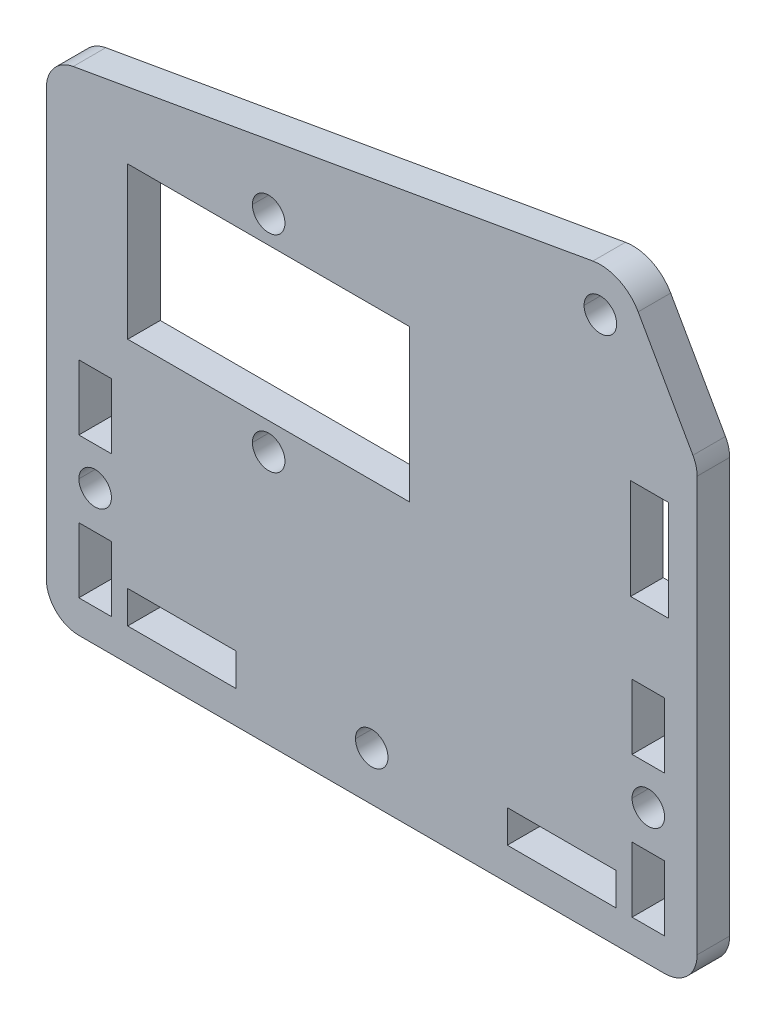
ISO-10303-21;
HEADER;
FILE_DESCRIPTION(('STEP AP214'),'2;1');
FILE_NAME('part.step','',(''),(''),'','','');
FILE_SCHEMA(('AUTOMOTIVE_DESIGN { 1 0 10303 214 1 1 1 1 }'));
ENDSEC;
DATA;
#1=APPLICATION_CONTEXT('core data for automotive mechanical design processes');
#2=APPLICATION_PROTOCOL_DEFINITION('international standard','automotive_design',2000,#1);
#3=PRODUCT_CONTEXT('',#1,'mechanical');
#4=PRODUCT('Part','Part','',(#3));
#5=PRODUCT_RELATED_PRODUCT_CATEGORY('part','',(#4));
#6=PRODUCT_DEFINITION_FORMATION('','',#4);
#7=PRODUCT_DEFINITION_CONTEXT('part definition',#1,'design');
#8=PRODUCT_DEFINITION('design','',#6,#7);
#9=PRODUCT_DEFINITION_SHAPE('','',#8);
#10=(LENGTH_UNIT() NAMED_UNIT(*) SI_UNIT(.MILLI.,.METRE.));
#11=(NAMED_UNIT(*) PLANE_ANGLE_UNIT() SI_UNIT($,.RADIAN.));
#12=(NAMED_UNIT(*) SI_UNIT($,.STERADIAN.) SOLID_ANGLE_UNIT());
#13=UNCERTAINTY_MEASURE_WITH_UNIT(LENGTH_MEASURE(1.E-05),#10,'distance_accuracy_value','');
#14=(GEOMETRIC_REPRESENTATION_CONTEXT(3) GLOBAL_UNCERTAINTY_ASSIGNED_CONTEXT((#13)) GLOBAL_UNIT_ASSIGNED_CONTEXT((#10,
#11,#12)) REPRESENTATION_CONTEXT('',''));
#15=CARTESIAN_POINT('',(0.,0.,0.));
#16=DIRECTION('',(0.,0.,1.));
#17=DIRECTION('',(1.,0.,0.));
#18=AXIS2_PLACEMENT_3D('',#15,#16,#17);
#19=CARTESIAN_POINT('',(103.12523298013,-11.4257955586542,0.));
#20=DIRECTION('',(0.,0.,-1.));
#21=DIRECTION('',(-1.,0.,0.));
#22=AXIS2_PLACEMENT_3D('',#19,#20,#21);
#23=PLANE('',#22);
#24=DIRECTION('',(-1.,0.,0.));
#25=VECTOR('',#24,1.);
#26=CARTESIAN_POINT('',(107.63,25.47,0.));
#27=LINE('',#26,#25);
#28=CARTESIAN_POINT('',(133.63,25.47,0.));
#29=VERTEX_POINT('',#28);
#30=CARTESIAN_POINT('',(107.63,25.47,0.));
#31=VERTEX_POINT('',#30);
#32=EDGE_CURVE('E413',#29,#31,#27,.T.);
#33=ORIENTED_EDGE('',*,*,#32,.T.);
#34=DIRECTION('',(0.,-1.,0.));
#35=VECTOR('',#34,1.);
#36=CARTESIAN_POINT('',(107.63,25.47,0.));
#37=LINE('',#36,#35);
#38=CARTESIAN_POINT('',(107.63,11.47,0.));
#39=VERTEX_POINT('',#38);
#40=EDGE_CURVE('E389',#31,#39,#37,.T.);
#41=ORIENTED_EDGE('',*,*,#40,.T.);
#42=DIRECTION('',(1.,0.,0.));
#43=VECTOR('',#42,1.);
#44=CARTESIAN_POINT('',(107.63,11.47,0.));
#45=LINE('',#44,#43);
#46=CARTESIAN_POINT('',(133.63,11.47,0.));
#47=VERTEX_POINT('',#46);
#48=EDGE_CURVE('E423',#39,#47,#45,.T.);
#49=ORIENTED_EDGE('',*,*,#48,.T.);
#50=DIRECTION('',(0.,1.,0.));
#51=VECTOR('',#50,1.);
#52=CARTESIAN_POINT('',(133.63,25.47,0.));
#53=LINE('',#52,#51);
#54=EDGE_CURVE('E426',#47,#29,#53,.T.);
#55=ORIENTED_EDGE('',*,*,#54,.T.);
#56=EDGE_LOOP('',(#33,#41,#49,#55));
#57=FACE_BOUND('',#56,.T.);
#58=DIRECTION('',(1.,0.,0.));
#59=VECTOR('',#58,1.);
#60=CARTESIAN_POINT('',(103.12523298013,1.57420444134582,0.));
#61=LINE('',#60,#59);
#62=CARTESIAN_POINT('',(106.12523298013,1.57420444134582,0.));
#63=VERTEX_POINT('',#62);
#64=CARTESIAN_POINT('',(103.12523298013,1.57420444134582,0.));
#65=VERTEX_POINT('',#64);
#66=EDGE_CURVE('E548',#63,#65,#61,.F.);
#67=ORIENTED_EDGE('',*,*,#66,.F.);
#68=DIRECTION('',(0.,1.,0.));
#69=VECTOR('',#68,1.);
#70=CARTESIAN_POINT('',(106.12523298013,1.57420444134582,0.));
#71=LINE('',#70,#69);
#72=CARTESIAN_POINT('',(106.12523298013,7.57420444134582,0.));
#73=VERTEX_POINT('',#72);
#74=EDGE_CURVE('E546',#73,#63,#71,.F.);
#75=ORIENTED_EDGE('',*,*,#74,.F.);
#76=DIRECTION('',(1.,0.,0.));
#77=VECTOR('',#76,1.);
#78=CARTESIAN_POINT('',(103.12523298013,7.57420444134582,0.));
#79=LINE('',#78,#77);
#80=CARTESIAN_POINT('',(103.12523298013,7.57420444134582,0.));
#81=VERTEX_POINT('',#80);
#82=EDGE_CURVE('E542',#81,#73,#79,.T.);
#83=ORIENTED_EDGE('',*,*,#82,.F.);
#84=DIRECTION('',(0.,1.,0.));
#85=VECTOR('',#84,1.);
#86=CARTESIAN_POINT('',(103.12523298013,1.57420444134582,0.));
#87=LINE('',#86,#85);
#88=EDGE_CURVE('E538',#65,#81,#87,.T.);
#89=ORIENTED_EDGE('',*,*,#88,.F.);
#90=EDGE_LOOP('',(#67,#75,#83,#89));
#91=FACE_BOUND('',#90,.T.);
#92=CARTESIAN_POINT('',(155.62523298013,-1.92579555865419,0.));
#93=DIRECTION('',(0.,0.,-1.));
#94=DIRECTION('',(-1.,0.,0.));
#95=AXIS2_PLACEMENT_3D('',#92,#93,#94);
#96=CIRCLE('',#95,1.50000000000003);
#97=CARTESIAN_POINT('',(154.12523298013,-1.92579555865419,0.));
#98=VERTEX_POINT('',#97);
#99=CARTESIAN_POINT('',(157.12523298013,-1.92579555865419,0.));
#100=VERTEX_POINT('',#99);
#101=EDGE_CURVE('E553',#98,#100,#96,.F.);
#102=ORIENTED_EDGE('',*,*,#101,.T.);
#103=CARTESIAN_POINT('',(155.62523298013,-1.92579555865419,0.));
#104=DIRECTION('',(0.,0.,-1.));
#105=DIRECTION('',(-1.,0.,0.));
#106=AXIS2_PLACEMENT_3D('',#103,#104,#105);
#107=CIRCLE('',#106,1.50000000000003);
#108=EDGE_CURVE('E557',#100,#98,#107,.F.);
#109=ORIENTED_EDGE('',*,*,#108,.T.);
#110=EDGE_LOOP('',(#102,#109));
#111=FACE_BOUND('',#110,.T.);
#112=CARTESIAN_POINT('',(120.62523298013,8.9742044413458,0.));
#113=DIRECTION('',(0.,0.,-1.));
#114=DIRECTION('',(-1.,0.,0.));
#115=AXIS2_PLACEMENT_3D('',#112,#113,#114);
#116=CIRCLE('',#115,1.5);
#117=CARTESIAN_POINT('',(119.12523298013,8.9742044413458,0.));
#118=VERTEX_POINT('',#117);
#119=CARTESIAN_POINT('',(122.12523298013,8.9742044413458,0.));
#120=VERTEX_POINT('',#119);
#121=EDGE_CURVE('E561',#118,#120,#116,.F.);
#122=ORIENTED_EDGE('',*,*,#121,.T.);
#123=CARTESIAN_POINT('',(120.62523298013,8.9742044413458,0.));
#124=DIRECTION('',(0.,0.,-1.));
#125=DIRECTION('',(-1.,0.,0.));
#126=AXIS2_PLACEMENT_3D('',#123,#124,#125);
#127=CIRCLE('',#126,1.5);
#128=EDGE_CURVE('E565',#120,#118,#127,.F.);
#129=ORIENTED_EDGE('',*,*,#128,.T.);
#130=EDGE_LOOP('',(#122,#129));
#131=FACE_BOUND('',#130,.T.);
#132=DIRECTION('',(1.,0.,0.));
#133=VECTOR('',#132,1.);
#134=CARTESIAN_POINT('',(152.62523298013,-8.42579555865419,0.));
#135=LINE('',#134,#133);
#136=CARTESIAN_POINT('',(142.62523298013,-8.42579555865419,0.));
#137=VERTEX_POINT('',#136);
#138=CARTESIAN_POINT('',(152.62523298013,-8.42579555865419,0.));
#139=VERTEX_POINT('',#138);
#140=EDGE_CURVE('E581',#137,#139,#135,.T.);
#141=ORIENTED_EDGE('',*,*,#140,.F.);
#142=DIRECTION('',(0.,1.,0.));
#143=VECTOR('',#142,1.);
#144=CARTESIAN_POINT('',(142.62523298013,-11.4257955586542,0.));
#145=LINE('',#144,#143);
#146=CARTESIAN_POINT('',(142.62523298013,-11.4257955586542,0.));
#147=VERTEX_POINT('',#146);
#148=EDGE_CURVE('E579',#147,#137,#145,.T.);
#149=ORIENTED_EDGE('',*,*,#148,.F.);
#150=DIRECTION('',(-1.,0.,0.));
#151=VECTOR('',#150,1.);
#152=CARTESIAN_POINT('',(152.62523298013,-11.4257955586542,0.));
#153=LINE('',#152,#151);
#154=CARTESIAN_POINT('',(152.62523298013,-11.4257955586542,0.));
#155=VERTEX_POINT('',#154);
#156=EDGE_CURVE('E575',#155,#147,#153,.T.);
#157=ORIENTED_EDGE('',*,*,#156,.F.);
#158=DIRECTION('',(0.,1.,0.));
#159=VECTOR('',#158,1.);
#160=CARTESIAN_POINT('',(152.62523298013,-11.4257955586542,0.));
#161=LINE('',#160,#159);
#162=EDGE_CURVE('E571',#139,#155,#161,.F.);
#163=ORIENTED_EDGE('',*,*,#162,.F.);
#164=EDGE_LOOP('',(#141,#149,#157,#163));
#165=FACE_BOUND('',#164,.T.);
#166=CARTESIAN_POINT('',(151.204843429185,35.2158187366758,0.));
#167=DIRECTION('',(0.,0.,-1.));
#168=DIRECTION('',(-1.,0.,0.));
#169=AXIS2_PLACEMENT_3D('',#166,#167,#168);
#170=CIRCLE('',#169,1.5);
#171=CARTESIAN_POINT('',(149.704843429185,35.2158187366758,0.));
#172=VERTEX_POINT('',#171);
#173=CARTESIAN_POINT('',(152.704843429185,35.2158187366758,0.));
#174=VERTEX_POINT('',#173);
#175=EDGE_CURVE('E586',#172,#174,#170,.F.);
#176=ORIENTED_EDGE('',*,*,#175,.T.);
#177=CARTESIAN_POINT('',(151.204843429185,35.2158187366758,0.));
#178=DIRECTION('',(0.,0.,-1.));
#179=DIRECTION('',(-1.,0.,0.));
#180=AXIS2_PLACEMENT_3D('',#177,#178,#179);
#181=CIRCLE('',#180,1.5);
#182=EDGE_CURVE('E590',#174,#172,#181,.F.);
#183=ORIENTED_EDGE('',*,*,#182,.T.);
#184=EDGE_LOOP('',(#176,#183));
#185=FACE_BOUND('',#184,.T.);
#186=DIRECTION('',(1.,0.,0.));
#187=VECTOR('',#186,1.);
#188=CARTESIAN_POINT('',(157.12523298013,-5.42579555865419,0.));
#189=LINE('',#188,#187);
#190=CARTESIAN_POINT('',(154.12523298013,-5.42579555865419,0.));
#191=VERTEX_POINT('',#190);
#192=CARTESIAN_POINT('',(157.12523298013,-5.42579555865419,0.));
#193=VERTEX_POINT('',#192);
#194=EDGE_CURVE('E606',#191,#193,#189,.T.);
#195=ORIENTED_EDGE('',*,*,#194,.F.);
#196=DIRECTION('',(0.,1.,0.));
#197=VECTOR('',#196,1.);
#198=CARTESIAN_POINT('',(154.12523298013,-11.4257955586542,0.));
#199=LINE('',#198,#197);
#200=CARTESIAN_POINT('',(154.12523298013,-11.4257955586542,0.));
#201=VERTEX_POINT('',#200);
#202=EDGE_CURVE('E604',#201,#191,#199,.T.);
#203=ORIENTED_EDGE('',*,*,#202,.F.);
#204=DIRECTION('',(1.,0.,0.));
#205=VECTOR('',#204,1.);
#206=CARTESIAN_POINT('',(157.12523298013,-11.4257955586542,0.));
#207=LINE('',#206,#205);
#208=CARTESIAN_POINT('',(157.12523298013,-11.4257955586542,0.));
#209=VERTEX_POINT('',#208);
#210=EDGE_CURVE('E600',#209,#201,#207,.F.);
#211=ORIENTED_EDGE('',*,*,#210,.F.);
#212=DIRECTION('',(0.,1.,0.));
#213=VECTOR('',#212,1.);
#214=CARTESIAN_POINT('',(157.12523298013,-11.4257955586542,0.));
#215=LINE('',#214,#213);
#216=EDGE_CURVE('E596',#193,#209,#215,.F.);
#217=ORIENTED_EDGE('',*,*,#216,.F.);
#218=EDGE_LOOP('',(#195,#203,#211,#217));
#219=FACE_BOUND('',#218,.T.);
#220=CARTESIAN_POINT('',(157.12523298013,-11.4257955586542,0.));
#221=DIRECTION('',(0.,0.,-1.));
#222=DIRECTION('',(-1.,0.,0.));
#223=AXIS2_PLACEMENT_3D('',#220,#221,#222);
#224=CIRCLE('',#223,3.);
#225=CARTESIAN_POINT('',(157.12523298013,-14.4257955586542,0.));
#226=VERTEX_POINT('',#225);
#227=CARTESIAN_POINT('',(160.12523298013,-11.4257955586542,0.));
#228=VERTEX_POINT('',#227);
#229=EDGE_CURVE('E620',#226,#228,#224,.F.);
#230=ORIENTED_EDGE('',*,*,#229,.F.);
#231=DIRECTION('',(-1.,0.,0.));
#232=VECTOR('',#231,1.);
#233=CARTESIAN_POINT('',(157.12523298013,-14.4257955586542,0.));
#234=LINE('',#233,#232);
#235=CARTESIAN_POINT('',(103.12523298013,-14.4257955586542,0.));
#236=VERTEX_POINT('',#235);
#237=EDGE_CURVE('E617',#226,#236,#234,.T.);
#238=ORIENTED_EDGE('',*,*,#237,.T.);
#239=CARTESIAN_POINT('',(103.12523298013,-11.4257955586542,0.));
#240=DIRECTION('',(0.,0.,-1.));
#241=DIRECTION('',(-1.,0.,0.));
#242=AXIS2_PLACEMENT_3D('',#239,#240,#241);
#243=CIRCLE('',#242,3.);
#244=CARTESIAN_POINT('',(100.12523298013,-11.4257955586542,0.));
#245=VERTEX_POINT('',#244);
#246=EDGE_CURVE('E611',#245,#236,#243,.F.);
#247=ORIENTED_EDGE('',*,*,#246,.F.);
#248=DIRECTION('',(0.,1.,0.));
#249=VECTOR('',#248,1.);
#250=CARTESIAN_POINT('',(100.12523298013,-11.4257955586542,0.));
#251=LINE('',#250,#249);
#252=CARTESIAN_POINT('',(100.12523298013,27.7810802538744,0.));
#253=VERTEX_POINT('',#252);
#254=EDGE_CURVE('E645',#245,#253,#251,.T.);
#255=ORIENTED_EDGE('',*,*,#254,.T.);
#256=CARTESIAN_POINT('',(103.12523298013,27.7810802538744,0.));
#257=DIRECTION('',(0.,0.,-1.));
#258=DIRECTION('',(-1.,0.,0.));
#259=AXIS2_PLACEMENT_3D('',#256,#257,#258);
#260=CIRCLE('',#259,3.);
#261=CARTESIAN_POINT('',(102.605937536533,30.7357938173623,0.));
#262=VERTEX_POINT('',#261);
#263=EDGE_CURVE('E641',#262,#253,#260,.F.);
#264=ORIENTED_EDGE('',*,*,#263,.F.);
#265=DIRECTION('',(0.984904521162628,0.173098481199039,0.));
#266=VECTOR('',#265,1.);
#267=CARTESIAN_POINT('',(102.605937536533,30.7357938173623,0.));
#268=LINE('',#267,#266);
#269=CARTESIAN_POINT('',(150.512449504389,39.1554368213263,0.));
#270=VERTEX_POINT('',#269);
#271=EDGE_CURVE('E638',#262,#270,#268,.T.);
#272=ORIENTED_EDGE('',*,*,#271,.T.);
#273=CARTESIAN_POINT('',(151.204843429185,35.2158187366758,0.));
#274=DIRECTION('',(0.,0.,-1.));
#275=DIRECTION('',(-1.,0.,0.));
#276=AXIS2_PLACEMENT_3D('',#273,#274,#275);
#277=CIRCLE('',#276,4.);
#278=CARTESIAN_POINT('',(154.68608767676,37.1858285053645,0.));
#279=VERTEX_POINT('',#278);
#280=EDGE_CURVE('E634',#279,#270,#277,.F.);
#281=ORIENTED_EDGE('',*,*,#280,.F.);
#282=DIRECTION('',(0.492502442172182,-0.870311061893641,0.));
#283=VECTOR('',#282,1.);
#284=CARTESIAN_POINT('',(159.736166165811,28.2617323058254,0.));
#285=LINE('',#284,#283);
#286=CARTESIAN_POINT('',(159.736166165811,28.2617323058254,0.));
#287=VERTEX_POINT('',#286);
#288=EDGE_CURVE('E625',#279,#287,#285,.T.);
#289=ORIENTED_EDGE('',*,*,#288,.T.);
#290=CARTESIAN_POINT('',(157.12523298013,26.7842249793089,0.));
#291=DIRECTION('',(0.,0.,-1.));
#292=DIRECTION('',(-1.,0.,0.));
#293=AXIS2_PLACEMENT_3D('',#290,#291,#292);
#294=CIRCLE('',#293,3.);
#295=CARTESIAN_POINT('',(160.12523298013,26.7842249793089,0.));
#296=VERTEX_POINT('',#295);
#297=EDGE_CURVE('E718',#287,#296,#294,.T.);
#298=ORIENTED_EDGE('',*,*,#297,.T.);
#299=DIRECTION('',(0.,1.,0.));
#300=VECTOR('',#299,1.);
#301=CARTESIAN_POINT('',(160.12523298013,-11.4257955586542,0.));
#302=LINE('',#301,#300);
#303=EDGE_CURVE('E624',#296,#228,#302,.F.);
#304=ORIENTED_EDGE('',*,*,#303,.T.);
#305=EDGE_LOOP('',(#230,#238,#247,#255,#264,#272,#281,#289,#298,#304));
#306=FACE_BOUND('',#305,.T.);
#307=DIRECTION('',(1.,0.,0.));
#308=VECTOR('',#307,1.);
#309=CARTESIAN_POINT('',(103.12523298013,-11.4257955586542,0.));
#310=LINE('',#309,#308);
#311=CARTESIAN_POINT('',(106.12523298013,-11.4257955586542,0.));
#312=VERTEX_POINT('',#311);
#313=CARTESIAN_POINT('',(103.12523298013,-11.4257955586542,0.));
#314=VERTEX_POINT('',#313);
#315=EDGE_CURVE('E658',#312,#314,#310,.F.);
#316=ORIENTED_EDGE('',*,*,#315,.F.);
#317=DIRECTION('',(0.,1.,0.));
#318=VECTOR('',#317,1.);
#319=CARTESIAN_POINT('',(106.12523298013,-11.4257955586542,0.));
#320=LINE('',#319,#318);
#321=CARTESIAN_POINT('',(106.12523298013,-5.42579555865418,0.));
#322=VERTEX_POINT('',#321);
#323=EDGE_CURVE('E656',#322,#312,#320,.F.);
#324=ORIENTED_EDGE('',*,*,#323,.F.);
#325=DIRECTION('',(1.,0.,0.));
#326=VECTOR('',#325,1.);
#327=CARTESIAN_POINT('',(103.12523298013,-5.42579555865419,0.));
#328=LINE('',#327,#326);
#329=CARTESIAN_POINT('',(103.12523298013,-5.42579555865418,0.));
#330=VERTEX_POINT('',#329);
#331=EDGE_CURVE('E652',#330,#322,#328,.T.);
#332=ORIENTED_EDGE('',*,*,#331,.F.);
#333=DIRECTION('',(0.,1.,0.));
#334=VECTOR('',#333,1.);
#335=CARTESIAN_POINT('',(103.12523298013,-11.4257955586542,0.));
#336=LINE('',#335,#334);
#337=EDGE_CURVE('E648',#314,#330,#336,.T.);
#338=ORIENTED_EDGE('',*,*,#337,.F.);
#339=EDGE_LOOP('',(#316,#324,#332,#338));
#340=FACE_BOUND('',#339,.T.);
#341=DIRECTION('',(1.,0.,0.));
#342=VECTOR('',#341,1.);
#343=CARTESIAN_POINT('',(117.62523298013,-8.42579555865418,0.));
#344=LINE('',#343,#342);
#345=CARTESIAN_POINT('',(107.62523298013,-8.42579555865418,0.));
#346=VERTEX_POINT('',#345);
#347=CARTESIAN_POINT('',(117.62523298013,-8.42579555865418,0.));
#348=VERTEX_POINT('',#347);
#349=EDGE_CURVE('E675',#346,#348,#344,.T.);
#350=ORIENTED_EDGE('',*,*,#349,.F.);
#351=DIRECTION('',(0.,1.,0.));
#352=VECTOR('',#351,1.);
#353=CARTESIAN_POINT('',(107.62523298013,-11.4257955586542,0.));
#354=LINE('',#353,#352);
#355=CARTESIAN_POINT('',(107.62523298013,-11.4257955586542,0.));
#356=VERTEX_POINT('',#355);
#357=EDGE_CURVE('E673',#356,#346,#354,.T.);
#358=ORIENTED_EDGE('',*,*,#357,.F.);
#359=DIRECTION('',(-1.,0.,0.));
#360=VECTOR('',#359,1.);
#361=CARTESIAN_POINT('',(117.62523298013,-11.4257955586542,0.));
#362=LINE('',#361,#360);
#363=CARTESIAN_POINT('',(117.62523298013,-11.4257955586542,0.));
#364=VERTEX_POINT('',#363);
#365=EDGE_CURVE('E669',#364,#356,#362,.T.);
#366=ORIENTED_EDGE('',*,*,#365,.F.);
#367=DIRECTION('',(0.,-1.,0.));
#368=VECTOR('',#367,1.);
#369=CARTESIAN_POINT('',(117.62523298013,-11.4257955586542,0.));
#370=LINE('',#369,#368);
#371=EDGE_CURVE('E665',#348,#364,#370,.T.);
#372=ORIENTED_EDGE('',*,*,#371,.F.);
#373=EDGE_LOOP('',(#350,#358,#366,#372));
#374=FACE_BOUND('',#373,.T.);
#375=CARTESIAN_POINT('',(130.12523298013,-9.92579555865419,0.));
#376=DIRECTION('',(0.,0.,-1.));
#377=DIRECTION('',(-1.,0.,0.));
#378=AXIS2_PLACEMENT_3D('',#375,#376,#377);
#379=CIRCLE('',#378,1.5);
#380=CARTESIAN_POINT('',(128.62523298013,-9.92579555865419,0.));
#381=VERTEX_POINT('',#380);
#382=CARTESIAN_POINT('',(131.62523298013,-9.92579555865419,0.));
#383=VERTEX_POINT('',#382);
#384=EDGE_CURVE('E680',#381,#383,#379,.F.);
#385=ORIENTED_EDGE('',*,*,#384,.T.);
#386=CARTESIAN_POINT('',(130.12523298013,-9.92579555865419,0.));
#387=DIRECTION('',(0.,0.,-1.));
#388=DIRECTION('',(-1.,0.,0.));
#389=AXIS2_PLACEMENT_3D('',#386,#387,#388);
#390=CIRCLE('',#389,1.5);
#391=EDGE_CURVE('E684',#383,#381,#390,.F.);
#392=ORIENTED_EDGE('',*,*,#391,.T.);
#393=EDGE_LOOP('',(#385,#392));
#394=FACE_BOUND('',#393,.T.);
#395=CARTESIAN_POINT('',(120.62523298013,27.9742044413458,0.));
#396=DIRECTION('',(0.,0.,-1.));
#397=DIRECTION('',(-1.,0.,0.));
#398=AXIS2_PLACEMENT_3D('',#395,#396,#397);
#399=CIRCLE('',#398,1.5);
#400=CARTESIAN_POINT('',(119.12523298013,27.9742044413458,0.));
#401=VERTEX_POINT('',#400);
#402=CARTESIAN_POINT('',(122.12523298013,27.9742044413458,0.));
#403=VERTEX_POINT('',#402);
#404=EDGE_CURVE('E688',#401,#403,#399,.F.);
#405=ORIENTED_EDGE('',*,*,#404,.T.);
#406=CARTESIAN_POINT('',(120.62523298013,27.9742044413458,0.));
#407=DIRECTION('',(0.,0.,-1.));
#408=DIRECTION('',(-1.,0.,0.));
#409=AXIS2_PLACEMENT_3D('',#406,#407,#408);
#410=CIRCLE('',#409,1.5);
#411=EDGE_CURVE('E692',#403,#401,#410,.F.);
#412=ORIENTED_EDGE('',*,*,#411,.T.);
#413=EDGE_LOOP('',(#405,#412));
#414=FACE_BOUND('',#413,.T.);
#415=CARTESIAN_POINT('',(104.62523298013,-1.92579555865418,0.));
#416=DIRECTION('',(0.,0.,-1.));
#417=DIRECTION('',(-1.,0.,0.));
#418=AXIS2_PLACEMENT_3D('',#415,#416,#417);
#419=CIRCLE('',#418,1.5);
#420=CARTESIAN_POINT('',(103.12523298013,-1.92579555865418,0.));
#421=VERTEX_POINT('',#420);
#422=CARTESIAN_POINT('',(106.12523298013,-1.92579555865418,0.));
#423=VERTEX_POINT('',#422);
#424=EDGE_CURVE('E696',#421,#423,#419,.F.);
#425=ORIENTED_EDGE('',*,*,#424,.T.);
#426=CARTESIAN_POINT('',(104.62523298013,-1.92579555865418,0.));
#427=DIRECTION('',(0.,0.,-1.));
#428=DIRECTION('',(-1.,0.,0.));
#429=AXIS2_PLACEMENT_3D('',#426,#427,#428);
#430=CIRCLE('',#429,1.5);
#431=EDGE_CURVE('E700',#423,#421,#430,.F.);
#432=ORIENTED_EDGE('',*,*,#431,.T.);
#433=EDGE_LOOP('',(#425,#432));
#434=FACE_BOUND('',#433,.T.);
#435=DIRECTION('',(1.,0.,0.));
#436=VECTOR('',#435,1.);
#437=CARTESIAN_POINT('',(154.12523298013,1.57420444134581,0.));
#438=LINE('',#437,#436);
#439=CARTESIAN_POINT('',(157.12523298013,1.57420444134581,0.));
#440=VERTEX_POINT('',#439);
#441=CARTESIAN_POINT('',(154.12523298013,1.57420444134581,0.));
#442=VERTEX_POINT('',#441);
#443=EDGE_CURVE('E716',#440,#442,#438,.F.);
#444=ORIENTED_EDGE('',*,*,#443,.F.);
#445=DIRECTION('',(0.,1.,0.));
#446=VECTOR('',#445,1.);
#447=CARTESIAN_POINT('',(157.12523298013,1.57420444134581,0.));
#448=LINE('',#447,#446);
#449=CARTESIAN_POINT('',(157.12523298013,7.57420444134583,0.));
#450=VERTEX_POINT('',#449);
#451=EDGE_CURVE('E714',#450,#440,#448,.F.);
#452=ORIENTED_EDGE('',*,*,#451,.F.);
#453=DIRECTION('',(1.,0.,0.));
#454=VECTOR('',#453,1.);
#455=CARTESIAN_POINT('',(154.12523298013,7.57420444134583,0.));
#456=LINE('',#455,#454);
#457=CARTESIAN_POINT('',(154.12523298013,7.57420444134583,0.));
#458=VERTEX_POINT('',#457);
#459=EDGE_CURVE('E710',#458,#450,#456,.T.);
#460=ORIENTED_EDGE('',*,*,#459,.F.);
#461=DIRECTION('',(0.,1.,0.));
#462=VECTOR('',#461,1.);
#463=CARTESIAN_POINT('',(154.12523298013,1.57420444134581,0.));
#464=LINE('',#463,#462);
#465=EDGE_CURVE('E706',#442,#458,#464,.T.);
#466=ORIENTED_EDGE('',*,*,#465,.F.);
#467=EDGE_LOOP('',(#444,#452,#460,#466));
#468=FACE_BOUND('',#467,.T.);
#469=DIRECTION('',(1.,0.,0.));
#470=VECTOR('',#469,1.);
#471=CARTESIAN_POINT('',(157.49312451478,14.1160360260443,0.));
#472=LINE('',#471,#470);
#473=CARTESIAN_POINT('',(153.99312451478,14.1160360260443,0.));
#474=VERTEX_POINT('',#473);
#475=CARTESIAN_POINT('',(157.49312451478,14.1160360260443,0.));
#476=VERTEX_POINT('',#475);
#477=EDGE_CURVE('E382',#474,#476,#472,.T.);
#478=ORIENTED_EDGE('',*,*,#477,.T.);
#479=DIRECTION('',(0.,1.,0.));
#480=VECTOR('',#479,1.);
#481=CARTESIAN_POINT('',(157.49312451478,14.1160360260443,0.));
#482=LINE('',#481,#480);
#483=CARTESIAN_POINT('',(157.49312451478,23.3660360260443,0.));
#484=VERTEX_POINT('',#483);
#485=EDGE_CURVE('E47',#476,#484,#482,.T.);
#486=ORIENTED_EDGE('',*,*,#485,.T.);
#487=DIRECTION('',(-1.,0.,0.));
#488=VECTOR('',#487,1.);
#489=CARTESIAN_POINT('',(157.49312451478,23.3660360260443,0.));
#490=LINE('',#489,#488);
#491=CARTESIAN_POINT('',(153.99312451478,23.3660360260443,0.));
#492=VERTEX_POINT('',#491);
#493=EDGE_CURVE('E388',#484,#492,#490,.T.);
#494=ORIENTED_EDGE('',*,*,#493,.T.);
#495=DIRECTION('',(0.,-1.,0.));
#496=VECTOR('',#495,1.);
#497=CARTESIAN_POINT('',(153.99312451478,14.1160360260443,0.));
#498=LINE('',#497,#496);
#499=EDGE_CURVE('E402',#492,#474,#498,.T.);
#500=ORIENTED_EDGE('',*,*,#499,.T.);
#501=EDGE_LOOP('',(#478,#486,#494,#500));
#502=FACE_BOUND('',#501,.T.);
#503=ADVANCED_FACE('F30',(#57,#91,#111,#131,#165,#185,#219,#306,#340,#374,#394,#414,#434,#468,
#502),#23,.T.);
#504=CARTESIAN_POINT('',(103.12523298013,-11.4257955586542,3.));
#505=DIRECTION('',(0.,0.,-1.));
#506=DIRECTION('',(-1.,0.,0.));
#507=AXIS2_PLACEMENT_3D('',#504,#505,#506);
#508=PLANE('',#507);
#509=DIRECTION('',(0.,-1.,0.));
#510=VECTOR('',#509,1.);
#511=CARTESIAN_POINT('',(107.63,25.47,3.));
#512=LINE('',#511,#510);
#513=CARTESIAN_POINT('',(107.63,25.47,3.));
#514=VERTEX_POINT('',#513);
#515=CARTESIAN_POINT('',(107.63,11.47,3.));
#516=VERTEX_POINT('',#515);
#517=EDGE_CURVE('E410',#514,#516,#512,.T.);
#518=ORIENTED_EDGE('',*,*,#517,.F.);
#519=DIRECTION('',(-1.,0.,0.));
#520=VECTOR('',#519,1.);
#521=CARTESIAN_POINT('',(107.63,25.47,3.));
#522=LINE('',#521,#520);
#523=CARTESIAN_POINT('',(133.63,25.47,3.));
#524=VERTEX_POINT('',#523);
#525=EDGE_CURVE('E418',#524,#514,#522,.T.);
#526=ORIENTED_EDGE('',*,*,#525,.F.);
#527=DIRECTION('',(0.,1.,0.));
#528=VECTOR('',#527,1.);
#529=CARTESIAN_POINT('',(133.63,25.47,3.));
#530=LINE('',#529,#528);
#531=CARTESIAN_POINT('',(133.63,11.47,3.));
#532=VERTEX_POINT('',#531);
#533=EDGE_CURVE('E415',#532,#524,#530,.T.);
#534=ORIENTED_EDGE('',*,*,#533,.F.);
#535=DIRECTION('',(1.,0.,0.));
#536=VECTOR('',#535,1.);
#537=CARTESIAN_POINT('',(107.63,11.47,3.));
#538=LINE('',#537,#536);
#539=EDGE_CURVE('E412',#516,#532,#538,.T.);
#540=ORIENTED_EDGE('',*,*,#539,.F.);
#541=EDGE_LOOP('',(#518,#526,#534,#540));
#542=FACE_BOUND('',#541,.T.);
#543=DIRECTION('',(-1.,0.,0.));
#544=VECTOR('',#543,1.);
#545=CARTESIAN_POINT('',(103.12523298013,7.57420444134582,3.));
#546=LINE('',#545,#544);
#547=CARTESIAN_POINT('',(106.12523298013,7.57420444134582,3.));
#548=VERTEX_POINT('',#547);
#549=CARTESIAN_POINT('',(103.12523298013,7.57420444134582,3.));
#550=VERTEX_POINT('',#549);
#551=EDGE_CURVE('E39',#548,#550,#546,.T.);
#552=ORIENTED_EDGE('',*,*,#551,.F.);
#553=DIRECTION('',(0.,1.,0.));
#554=VECTOR('',#553,1.);
#555=CARTESIAN_POINT('',(106.12523298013,-11.4257955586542,3.));
#556=LINE('',#555,#554);
#557=CARTESIAN_POINT('',(106.12523298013,1.57420444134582,3.));
#558=VERTEX_POINT('',#557);
#559=EDGE_CURVE('E442',#558,#548,#556,.T.);
#560=ORIENTED_EDGE('',*,*,#559,.F.);
#561=DIRECTION('',(-1.,0.,0.));
#562=VECTOR('',#561,1.);
#563=CARTESIAN_POINT('',(103.12523298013,1.57420444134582,3.));
#564=LINE('',#563,#562);
#565=CARTESIAN_POINT('',(103.12523298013,1.57420444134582,3.));
#566=VERTEX_POINT('',#565);
#567=EDGE_CURVE('E445',#566,#558,#564,.F.);
#568=ORIENTED_EDGE('',*,*,#567,.F.);
#569=DIRECTION('',(0.,1.,0.));
#570=VECTOR('',#569,1.);
#571=CARTESIAN_POINT('',(103.12523298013,-11.4257955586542,3.));
#572=LINE('',#571,#570);
#573=EDGE_CURVE('E11',#550,#566,#572,.F.);
#574=ORIENTED_EDGE('',*,*,#573,.F.);
#575=EDGE_LOOP('',(#552,#560,#568,#574));
#576=FACE_BOUND('',#575,.T.);
#577=CARTESIAN_POINT('',(155.62523298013,-1.92579555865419,3.));
#578=DIRECTION('',(0.,0.,-1.));
#579=DIRECTION('',(-1.,0.,0.));
#580=AXIS2_PLACEMENT_3D('',#577,#578,#579);
#581=CIRCLE('',#580,1.50000000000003);
#582=CARTESIAN_POINT('',(157.12523298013,-1.92579555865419,3.));
#583=VERTEX_POINT('',#582);
#584=CARTESIAN_POINT('',(154.12523298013,-1.92579555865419,3.));
#585=VERTEX_POINT('',#584);
#586=EDGE_CURVE('E731',#583,#585,#581,.F.);
#587=ORIENTED_EDGE('',*,*,#586,.F.);
#588=CARTESIAN_POINT('',(155.62523298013,-1.92579555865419,3.));
#589=DIRECTION('',(0.,0.,-1.));
#590=DIRECTION('',(-1.,0.,0.));
#591=AXIS2_PLACEMENT_3D('',#588,#589,#590);
#592=CIRCLE('',#591,1.50000000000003);
#593=EDGE_CURVE('E448',#585,#583,#592,.F.);
#594=ORIENTED_EDGE('',*,*,#593,.F.);
#595=EDGE_LOOP('',(#587,#594));
#596=FACE_BOUND('',#595,.T.);
#597=CARTESIAN_POINT('',(120.62523298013,8.9742044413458,3.));
#598=DIRECTION('',(0.,0.,-1.));
#599=DIRECTION('',(-1.,0.,0.));
#600=AXIS2_PLACEMENT_3D('',#597,#598,#599);
#601=CIRCLE('',#600,1.5);
#602=CARTESIAN_POINT('',(122.12523298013,8.9742044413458,3.));
#603=VERTEX_POINT('',#602);
#604=CARTESIAN_POINT('',(119.12523298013,8.9742044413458,3.));
#605=VERTEX_POINT('',#604);
#606=EDGE_CURVE('E452',#603,#605,#601,.F.);
#607=ORIENTED_EDGE('',*,*,#606,.F.);
#608=CARTESIAN_POINT('',(120.62523298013,8.9742044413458,3.));
#609=DIRECTION('',(0.,0.,-1.));
#610=DIRECTION('',(-1.,0.,0.));
#611=AXIS2_PLACEMENT_3D('',#608,#609,#610);
#612=CIRCLE('',#611,1.5);
#613=EDGE_CURVE('E734',#605,#603,#612,.F.);
#614=ORIENTED_EDGE('',*,*,#613,.F.);
#615=EDGE_LOOP('',(#607,#614));
#616=FACE_BOUND('',#615,.T.);
#617=DIRECTION('',(-1.,0.,0.));
#618=VECTOR('',#617,1.);
#619=CARTESIAN_POINT('',(103.12523298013,-11.4257955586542,3.));
#620=LINE('',#619,#618);
#621=CARTESIAN_POINT('',(142.62523298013,-11.4257955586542,3.));
#622=VERTEX_POINT('',#621);
#623=CARTESIAN_POINT('',(152.62523298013,-11.4257955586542,3.));
#624=VERTEX_POINT('',#623);
#625=EDGE_CURVE('E453',#622,#624,#620,.F.);
#626=ORIENTED_EDGE('',*,*,#625,.F.);
#627=DIRECTION('',(0.,1.,0.));
#628=VECTOR('',#627,1.);
#629=CARTESIAN_POINT('',(142.62523298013,-11.4257955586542,3.));
#630=LINE('',#629,#628);
#631=CARTESIAN_POINT('',(142.62523298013,-8.42579555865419,3.));
#632=VERTEX_POINT('',#631);
#633=EDGE_CURVE('E456',#632,#622,#630,.F.);
#634=ORIENTED_EDGE('',*,*,#633,.F.);
#635=DIRECTION('',(-1.,0.,0.));
#636=VECTOR('',#635,1.);
#637=CARTESIAN_POINT('',(103.12523298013,-8.42579555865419,3.));
#638=LINE('',#637,#636);
#639=CARTESIAN_POINT('',(152.62523298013,-8.42579555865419,3.));
#640=VERTEX_POINT('',#639);
#641=EDGE_CURVE('E459',#640,#632,#638,.T.);
#642=ORIENTED_EDGE('',*,*,#641,.F.);
#643=DIRECTION('',(0.,1.,0.));
#644=VECTOR('',#643,1.);
#645=CARTESIAN_POINT('',(152.62523298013,-11.4257955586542,3.));
#646=LINE('',#645,#644);
#647=EDGE_CURVE('E449',#624,#640,#646,.T.);
#648=ORIENTED_EDGE('',*,*,#647,.F.);
#649=EDGE_LOOP('',(#626,#634,#642,#648));
#650=FACE_BOUND('',#649,.T.);
#651=CARTESIAN_POINT('',(151.204843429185,35.2158187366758,3.));
#652=DIRECTION('',(0.,0.,-1.));
#653=DIRECTION('',(-1.,0.,0.));
#654=AXIS2_PLACEMENT_3D('',#651,#652,#653);
#655=CIRCLE('',#654,1.5);
#656=CARTESIAN_POINT('',(152.704843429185,35.2158187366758,3.));
#657=VERTEX_POINT('',#656);
#658=CARTESIAN_POINT('',(149.704843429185,35.2158187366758,3.));
#659=VERTEX_POINT('',#658);
#660=EDGE_CURVE('E466',#657,#659,#655,.F.);
#661=ORIENTED_EDGE('',*,*,#660,.F.);
#662=CARTESIAN_POINT('',(151.204843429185,35.2158187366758,3.));
#663=DIRECTION('',(0.,0.,-1.));
#664=DIRECTION('',(-1.,0.,0.));
#665=AXIS2_PLACEMENT_3D('',#662,#663,#664);
#666=CIRCLE('',#665,1.5);
#667=EDGE_CURVE('E462',#659,#657,#666,.F.);
#668=ORIENTED_EDGE('',*,*,#667,.F.);
#669=EDGE_LOOP('',(#661,#668));
#670=FACE_BOUND('',#669,.T.);
#671=DIRECTION('',(-1.,0.,0.));
#672=VECTOR('',#671,1.);
#673=CARTESIAN_POINT('',(103.12523298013,-11.4257955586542,3.));
#674=LINE('',#673,#672);
#675=CARTESIAN_POINT('',(154.12523298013,-11.4257955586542,3.));
#676=VERTEX_POINT('',#675);
#677=CARTESIAN_POINT('',(157.12523298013,-11.4257955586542,3.));
#678=VERTEX_POINT('',#677);
#679=EDGE_CURVE('E467',#676,#678,#674,.F.);
#680=ORIENTED_EDGE('',*,*,#679,.F.);
#681=DIRECTION('',(0.,1.,0.));
#682=VECTOR('',#681,1.);
#683=CARTESIAN_POINT('',(154.12523298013,-11.4257955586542,3.));
#684=LINE('',#683,#682);
#685=CARTESIAN_POINT('',(154.12523298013,-5.42579555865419,3.));
#686=VERTEX_POINT('',#685);
#687=EDGE_CURVE('E470',#686,#676,#684,.F.);
#688=ORIENTED_EDGE('',*,*,#687,.F.);
#689=DIRECTION('',(-1.,0.,0.));
#690=VECTOR('',#689,1.);
#691=CARTESIAN_POINT('',(103.12523298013,-5.42579555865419,3.));
#692=LINE('',#691,#690);
#693=CARTESIAN_POINT('',(157.12523298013,-5.42579555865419,3.));
#694=VERTEX_POINT('',#693);
#695=EDGE_CURVE('E473',#694,#686,#692,.T.);
#696=ORIENTED_EDGE('',*,*,#695,.F.);
#697=DIRECTION('',(0.,1.,0.));
#698=VECTOR('',#697,1.);
#699=CARTESIAN_POINT('',(157.12523298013,-11.4257955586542,3.));
#700=LINE('',#699,#698);
#701=EDGE_CURVE('E463',#678,#694,#700,.T.);
#702=ORIENTED_EDGE('',*,*,#701,.F.);
#703=EDGE_LOOP('',(#680,#688,#696,#702));
#704=FACE_BOUND('',#703,.T.);
#705=DIRECTION('',(-1.,0.,0.));
#706=VECTOR('',#705,1.);
#707=CARTESIAN_POINT('',(103.12523298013,-14.4257955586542,3.));
#708=LINE('',#707,#706);
#709=CARTESIAN_POINT('',(157.12523298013,-14.4257955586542,3.));
#710=VERTEX_POINT('',#709);
#711=CARTESIAN_POINT('',(103.12523298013,-14.4257955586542,3.));
#712=VERTEX_POINT('',#711);
#713=EDGE_CURVE('E477',#710,#712,#708,.T.);
#714=ORIENTED_EDGE('',*,*,#713,.F.);
#715=CARTESIAN_POINT('',(157.12523298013,-11.4257955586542,3.));
#716=DIRECTION('',(0.,0.,-1.));
#717=DIRECTION('',(-1.,0.,0.));
#718=AXIS2_PLACEMENT_3D('',#715,#716,#717);
#719=CIRCLE('',#718,3.);
#720=CARTESIAN_POINT('',(160.12523298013,-11.4257955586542,3.));
#721=VERTEX_POINT('',#720);
#722=EDGE_CURVE('E480',#721,#710,#719,.T.);
#723=ORIENTED_EDGE('',*,*,#722,.F.);
#724=DIRECTION('',(0.,1.,0.));
#725=VECTOR('',#724,1.);
#726=CARTESIAN_POINT('',(160.12523298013,-11.4257955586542,3.));
#727=LINE('',#726,#725);
#728=CARTESIAN_POINT('',(160.12523298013,26.7842249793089,3.));
#729=VERTEX_POINT('',#728);
#730=EDGE_CURVE('E481',#729,#721,#727,.F.);
#731=ORIENTED_EDGE('',*,*,#730,.F.);
#732=CARTESIAN_POINT('',(157.12523298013,26.7842249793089,3.));
#733=DIRECTION('',(0.,0.,-1.));
#734=DIRECTION('',(-1.,0.,0.));
#735=AXIS2_PLACEMENT_3D('',#732,#733,#734);
#736=CIRCLE('',#735,3.);
#737=CARTESIAN_POINT('',(159.736166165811,28.2617323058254,3.));
#738=VERTEX_POINT('',#737);
#739=EDGE_CURVE('E34',#738,#729,#736,.T.);
#740=ORIENTED_EDGE('',*,*,#739,.F.);
#741=DIRECTION('',(0.49250244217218,-0.870311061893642,0.));
#742=VECTOR('',#741,1.);
#743=CARTESIAN_POINT('',(154.68608767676,37.1858285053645,3.));
#744=LINE('',#743,#742);
#745=CARTESIAN_POINT('',(154.68608767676,37.1858285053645,3.));
#746=VERTEX_POINT('',#745);
#747=EDGE_CURVE('E484',#746,#738,#744,.T.);
#748=ORIENTED_EDGE('',*,*,#747,.F.);
#749=CARTESIAN_POINT('',(151.204843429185,35.2158187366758,3.));
#750=DIRECTION('',(0.,0.,-1.));
#751=DIRECTION('',(-1.,0.,0.));
#752=AXIS2_PLACEMENT_3D('',#749,#750,#751);
#753=CIRCLE('',#752,4.);
#754=CARTESIAN_POINT('',(150.512449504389,39.1554368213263,3.));
#755=VERTEX_POINT('',#754);
#756=EDGE_CURVE('E487',#755,#746,#753,.T.);
#757=ORIENTED_EDGE('',*,*,#756,.F.);
#758=DIRECTION('',(0.984904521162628,0.173098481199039,0.));
#759=VECTOR('',#758,1.);
#760=CARTESIAN_POINT('',(102.605937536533,30.7357938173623,3.));
#761=LINE('',#760,#759);
#762=CARTESIAN_POINT('',(102.605937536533,30.7357938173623,3.));
#763=VERTEX_POINT('',#762);
#764=EDGE_CURVE('E488',#763,#755,#761,.T.);
#765=ORIENTED_EDGE('',*,*,#764,.F.);
#766=CARTESIAN_POINT('',(103.12523298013,27.7810802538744,3.));
#767=DIRECTION('',(0.,0.,-1.));
#768=DIRECTION('',(-1.,0.,0.));
#769=AXIS2_PLACEMENT_3D('',#766,#767,#768);
#770=CIRCLE('',#769,3.);
#771=CARTESIAN_POINT('',(100.12523298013,27.7810802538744,3.));
#772=VERTEX_POINT('',#771);
#773=EDGE_CURVE('E491',#772,#763,#770,.T.);
#774=ORIENTED_EDGE('',*,*,#773,.F.);
#775=DIRECTION('',(0.,1.,0.));
#776=VECTOR('',#775,1.);
#777=CARTESIAN_POINT('',(100.12523298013,-11.4257955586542,3.));
#778=LINE('',#777,#776);
#779=CARTESIAN_POINT('',(100.12523298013,-11.4257955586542,3.));
#780=VERTEX_POINT('',#779);
#781=EDGE_CURVE('E492',#780,#772,#778,.T.);
#782=ORIENTED_EDGE('',*,*,#781,.F.);
#783=CARTESIAN_POINT('',(103.12523298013,-11.4257955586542,3.));
#784=DIRECTION('',(0.,0.,-1.));
#785=DIRECTION('',(-1.,0.,0.));
#786=AXIS2_PLACEMENT_3D('',#783,#784,#785);
#787=CIRCLE('',#786,3.);
#788=EDGE_CURVE('E476',#712,#780,#787,.T.);
#789=ORIENTED_EDGE('',*,*,#788,.F.);
#790=EDGE_LOOP('',(#714,#723,#731,#740,#748,#757,#765,#774,#782,#789));
#791=FACE_BOUND('',#790,.T.);
#792=DIRECTION('',(-1.,0.,0.));
#793=VECTOR('',#792,1.);
#794=CARTESIAN_POINT('',(103.12523298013,-5.42579555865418,3.));
#795=LINE('',#794,#793);
#796=CARTESIAN_POINT('',(106.12523298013,-5.42579555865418,3.));
#797=VERTEX_POINT('',#796);
#798=CARTESIAN_POINT('',(103.12523298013,-5.42579555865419,3.));
#799=VERTEX_POINT('',#798);
#800=EDGE_CURVE('E498',#797,#799,#795,.T.);
#801=ORIENTED_EDGE('',*,*,#800,.F.);
#802=DIRECTION('',(0.,1.,0.));
#803=VECTOR('',#802,1.);
#804=CARTESIAN_POINT('',(106.12523298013,-11.4257955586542,3.));
#805=LINE('',#804,#803);
#806=CARTESIAN_POINT('',(106.12523298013,-11.4257955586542,3.));
#807=VERTEX_POINT('',#806);
#808=EDGE_CURVE('E501',#807,#797,#805,.T.);
#809=ORIENTED_EDGE('',*,*,#808,.F.);
#810=DIRECTION('',(-1.,0.,0.));
#811=VECTOR('',#810,1.);
#812=CARTESIAN_POINT('',(103.12523298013,-11.4257955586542,3.));
#813=LINE('',#812,#811);
#814=CARTESIAN_POINT('',(103.12523298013,-11.4257955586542,3.));
#815=VERTEX_POINT('',#814);
#816=EDGE_CURVE('E504',#815,#807,#813,.F.);
#817=ORIENTED_EDGE('',*,*,#816,.F.);
#818=DIRECTION('',(0.,1.,0.));
#819=VECTOR('',#818,1.);
#820=CARTESIAN_POINT('',(103.12523298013,-11.4257955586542,3.));
#821=LINE('',#820,#819);
#822=EDGE_CURVE('E495',#799,#815,#821,.F.);
#823=ORIENTED_EDGE('',*,*,#822,.F.);
#824=EDGE_LOOP('',(#801,#809,#817,#823));
#825=FACE_BOUND('',#824,.T.);
#826=DIRECTION('',(-1.,0.,0.));
#827=VECTOR('',#826,1.);
#828=CARTESIAN_POINT('',(103.12523298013,-11.4257955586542,3.));
#829=LINE('',#828,#827);
#830=CARTESIAN_POINT('',(107.62523298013,-11.4257955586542,3.));
#831=VERTEX_POINT('',#830);
#832=CARTESIAN_POINT('',(117.62523298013,-11.4257955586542,3.));
#833=VERTEX_POINT('',#832);
#834=EDGE_CURVE('E510',#831,#833,#829,.F.);
#835=ORIENTED_EDGE('',*,*,#834,.F.);
#836=DIRECTION('',(0.,1.,0.));
#837=VECTOR('',#836,1.);
#838=CARTESIAN_POINT('',(107.62523298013,-11.4257955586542,3.));
#839=LINE('',#838,#837);
#840=CARTESIAN_POINT('',(107.62523298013,-8.42579555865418,3.));
#841=VERTEX_POINT('',#840);
#842=EDGE_CURVE('E513',#841,#831,#839,.F.);
#843=ORIENTED_EDGE('',*,*,#842,.F.);
#844=DIRECTION('',(-1.,0.,0.));
#845=VECTOR('',#844,1.);
#846=CARTESIAN_POINT('',(103.12523298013,-8.42579555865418,3.));
#847=LINE('',#846,#845);
#848=CARTESIAN_POINT('',(117.62523298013,-8.42579555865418,3.));
#849=VERTEX_POINT('',#848);
#850=EDGE_CURVE('E516',#849,#841,#847,.T.);
#851=ORIENTED_EDGE('',*,*,#850,.F.);
#852=DIRECTION('',(0.,1.,0.));
#853=VECTOR('',#852,1.);
#854=CARTESIAN_POINT('',(117.62523298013,-11.4257955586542,3.));
#855=LINE('',#854,#853);
#856=EDGE_CURVE('E507',#833,#849,#855,.T.);
#857=ORIENTED_EDGE('',*,*,#856,.F.);
#858=EDGE_LOOP('',(#835,#843,#851,#857));
#859=FACE_BOUND('',#858,.T.);
#860=CARTESIAN_POINT('',(130.12523298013,-9.92579555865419,3.));
#861=DIRECTION('',(0.,0.,-1.));
#862=DIRECTION('',(-1.,0.,0.));
#863=AXIS2_PLACEMENT_3D('',#860,#861,#862);
#864=CIRCLE('',#863,1.5);
#865=CARTESIAN_POINT('',(131.62523298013,-9.92579555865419,3.));
#866=VERTEX_POINT('',#865);
#867=CARTESIAN_POINT('',(128.62523298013,-9.92579555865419,3.));
#868=VERTEX_POINT('',#867);
#869=EDGE_CURVE('E753',#866,#868,#864,.F.);
#870=ORIENTED_EDGE('',*,*,#869,.F.);
#871=CARTESIAN_POINT('',(130.12523298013,-9.92579555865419,3.));
#872=DIRECTION('',(0.,0.,-1.));
#873=DIRECTION('',(-1.,0.,0.));
#874=AXIS2_PLACEMENT_3D('',#871,#872,#873);
#875=CIRCLE('',#874,1.5);
#876=EDGE_CURVE('E519',#868,#866,#875,.F.);
#877=ORIENTED_EDGE('',*,*,#876,.F.);
#878=EDGE_LOOP('',(#870,#877));
#879=FACE_BOUND('',#878,.T.);
#880=CARTESIAN_POINT('',(120.62523298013,27.9742044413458,3.));
#881=DIRECTION('',(0.,0.,-1.));
#882=DIRECTION('',(-1.,0.,0.));
#883=AXIS2_PLACEMENT_3D('',#880,#881,#882);
#884=CIRCLE('',#883,1.5);
#885=CARTESIAN_POINT('',(122.12523298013,27.9742044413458,3.));
#886=VERTEX_POINT('',#885);
#887=CARTESIAN_POINT('',(119.12523298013,27.9742044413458,3.));
#888=VERTEX_POINT('',#887);
#889=EDGE_CURVE('E759',#886,#888,#884,.F.);
#890=ORIENTED_EDGE('',*,*,#889,.F.);
#891=CARTESIAN_POINT('',(120.62523298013,27.9742044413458,3.));
#892=DIRECTION('',(0.,0.,-1.));
#893=DIRECTION('',(-1.,0.,0.));
#894=AXIS2_PLACEMENT_3D('',#891,#892,#893);
#895=CIRCLE('',#894,1.5);
#896=EDGE_CURVE('E756',#888,#886,#895,.F.);
#897=ORIENTED_EDGE('',*,*,#896,.F.);
#898=EDGE_LOOP('',(#890,#897));
#899=FACE_BOUND('',#898,.T.);
#900=CARTESIAN_POINT('',(104.62523298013,-1.92579555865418,3.));
#901=DIRECTION('',(0.,0.,-1.));
#902=DIRECTION('',(-1.,0.,0.));
#903=AXIS2_PLACEMENT_3D('',#900,#901,#902);
#904=CIRCLE('',#903,1.5);
#905=CARTESIAN_POINT('',(106.12523298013,-1.92579555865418,3.));
#906=VERTEX_POINT('',#905);
#907=CARTESIAN_POINT('',(103.12523298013,-1.92579555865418,3.));
#908=VERTEX_POINT('',#907);
#909=EDGE_CURVE('E523',#906,#908,#904,.F.);
#910=ORIENTED_EDGE('',*,*,#909,.F.);
#911=CARTESIAN_POINT('',(104.62523298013,-1.92579555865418,3.));
#912=DIRECTION('',(0.,0.,-1.));
#913=DIRECTION('',(-1.,0.,0.));
#914=AXIS2_PLACEMENT_3D('',#911,#912,#913);
#915=CIRCLE('',#914,1.5);
#916=EDGE_CURVE('E762',#908,#906,#915,.F.);
#917=ORIENTED_EDGE('',*,*,#916,.F.);
#918=EDGE_LOOP('',(#910,#917));
#919=FACE_BOUND('',#918,.T.);
#920=DIRECTION('',(-1.,0.,0.));
#921=VECTOR('',#920,1.);
#922=CARTESIAN_POINT('',(103.12523298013,7.57420444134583,3.));
#923=LINE('',#922,#921);
#924=CARTESIAN_POINT('',(157.12523298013,7.57420444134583,3.));
#925=VERTEX_POINT('',#924);
#926=CARTESIAN_POINT('',(154.12523298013,7.57420444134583,3.));
#927=VERTEX_POINT('',#926);
#928=EDGE_CURVE('E524',#925,#927,#923,.T.);
#929=ORIENTED_EDGE('',*,*,#928,.F.);
#930=DIRECTION('',(0.,1.,0.));
#931=VECTOR('',#930,1.);
#932=CARTESIAN_POINT('',(157.12523298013,-11.4257955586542,3.));
#933=LINE('',#932,#931);
#934=CARTESIAN_POINT('',(157.12523298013,1.57420444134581,3.));
#935=VERTEX_POINT('',#934);
#936=EDGE_CURVE('E527',#935,#925,#933,.T.);
#937=ORIENTED_EDGE('',*,*,#936,.F.);
#938=DIRECTION('',(-1.,0.,0.));
#939=VECTOR('',#938,1.);
#940=CARTESIAN_POINT('',(103.12523298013,1.57420444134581,3.));
#941=LINE('',#940,#939);
#942=CARTESIAN_POINT('',(154.12523298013,1.57420444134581,3.));
#943=VERTEX_POINT('',#942);
#944=EDGE_CURVE('E530',#943,#935,#941,.F.);
#945=ORIENTED_EDGE('',*,*,#944,.F.);
#946=DIRECTION('',(0.,1.,0.));
#947=VECTOR('',#946,1.);
#948=CARTESIAN_POINT('',(154.12523298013,-11.4257955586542,3.));
#949=LINE('',#948,#947);
#950=EDGE_CURVE('E520',#927,#943,#949,.F.);
#951=ORIENTED_EDGE('',*,*,#950,.F.);
#952=EDGE_LOOP('',(#929,#937,#945,#951));
#953=FACE_BOUND('',#952,.T.);
#954=DIRECTION('',(0.,1.,0.));
#955=VECTOR('',#954,1.);
#956=CARTESIAN_POINT('',(157.49312451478,14.1160360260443,3.));
#957=LINE('',#956,#955);
#958=CARTESIAN_POINT('',(157.49312451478,14.1160360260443,3.));
#959=VERTEX_POINT('',#958);
#960=CARTESIAN_POINT('',(157.49312451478,23.3660360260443,3.));
#961=VERTEX_POINT('',#960);
#962=EDGE_CURVE('E373',#959,#961,#957,.T.);
#963=ORIENTED_EDGE('',*,*,#962,.F.);
#964=DIRECTION('',(1.,0.,0.));
#965=VECTOR('',#964,1.);
#966=CARTESIAN_POINT('',(157.49312451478,14.1160360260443,3.));
#967=LINE('',#966,#965);
#968=CARTESIAN_POINT('',(153.99312451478,14.1160360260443,3.));
#969=VERTEX_POINT('',#968);
#970=EDGE_CURVE('E396',#969,#959,#967,.T.);
#971=ORIENTED_EDGE('',*,*,#970,.F.);
#972=DIRECTION('',(0.,-1.,0.));
#973=VECTOR('',#972,1.);
#974=CARTESIAN_POINT('',(153.99312451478,14.1160360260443,3.));
#975=LINE('',#974,#973);
#976=CARTESIAN_POINT('',(153.99312451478,23.3660360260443,3.));
#977=VERTEX_POINT('',#976);
#978=EDGE_CURVE('E394',#977,#969,#975,.T.);
#979=ORIENTED_EDGE('',*,*,#978,.F.);
#980=DIRECTION('',(-1.,0.,0.));
#981=VECTOR('',#980,1.);
#982=CARTESIAN_POINT('',(157.49312451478,23.3660360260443,3.));
#983=LINE('',#982,#981);
#984=EDGE_CURVE('E381',#961,#977,#983,.T.);
#985=ORIENTED_EDGE('',*,*,#984,.F.);
#986=EDGE_LOOP('',(#963,#971,#979,#985));
#987=FACE_BOUND('',#986,.T.);
#988=ADVANCED_FACE('F393',(#542,#576,#596,#616,#650,#670,#704,#791,#825,#859,#879,#899,#919,
#953,#987),#508,.F.);
#989=CARTESIAN_POINT('',(157.12523298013,26.7842249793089,3.));
#990=DIRECTION('',(0.,0.,-1.));
#991=DIRECTION('',(-1.,0.,0.));
#992=AXIS2_PLACEMENT_3D('',#989,#990,#991);
#993=CYLINDRICAL_SURFACE('',#992,3.);
#994=ORIENTED_EDGE('',*,*,#739,.T.);
#995=DIRECTION('',(0.,0.,1.));
#996=VECTOR('',#995,1.);
#997=CARTESIAN_POINT('',(160.12523298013,26.7842249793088,3.));
#998=LINE('',#997,#996);
#999=EDGE_CURVE('E621',#729,#296,#998,.F.);
#1000=ORIENTED_EDGE('',*,*,#999,.T.);
#1001=ORIENTED_EDGE('',*,*,#297,.F.);
#1002=DIRECTION('',(0.,0.,1.));
#1003=VECTOR('',#1002,1.);
#1004=CARTESIAN_POINT('',(159.736166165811,28.2617323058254,3.));
#1005=LINE('',#1004,#1003);
#1006=EDGE_CURVE('E629',#287,#738,#1005,.T.);
#1007=ORIENTED_EDGE('',*,*,#1006,.T.);
#1008=EDGE_LOOP('',(#994,#1000,#1001,#1007));
#1009=FACE_BOUND('',#1008,.T.);
#1010=ADVANCED_FACE('F32',(#1009),#993,.T.);
#1011=CARTESIAN_POINT('',(154.12523298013,1.57420444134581,3.));
#1012=DIRECTION('',(0.,1.,0.));
#1013=DIRECTION('',(0.,0.,1.));
#1014=AXIS2_PLACEMENT_3D('',#1011,#1012,#1013);
#1015=PLANE('',#1014);
#1016=ORIENTED_EDGE('',*,*,#944,.T.);
#1017=DIRECTION('',(0.,0.,1.));
#1018=VECTOR('',#1017,1.);
#1019=CARTESIAN_POINT('',(157.12523298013,1.57420444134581,3.));
#1020=LINE('',#1019,#1018);
#1021=EDGE_CURVE('E712',#440,#935,#1020,.T.);
#1022=ORIENTED_EDGE('',*,*,#1021,.F.);
#1023=ORIENTED_EDGE('',*,*,#443,.T.);
#1024=DIRECTION('',(0.,0.,-1.));
#1025=VECTOR('',#1024,1.);
#1026=CARTESIAN_POINT('',(154.12523298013,1.57420444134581,3.));
#1027=LINE('',#1026,#1025);
#1028=EDGE_CURVE('E701',#943,#442,#1027,.T.);
#1029=ORIENTED_EDGE('',*,*,#1028,.F.);
#1030=EDGE_LOOP('',(#1016,#1022,#1023,#1029));
#1031=FACE_BOUND('',#1030,.T.);
#1032=ADVANCED_FACE('F1035',(#1031),#1015,.T.);
#1033=CARTESIAN_POINT('',(157.12523298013,1.57420444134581,3.));
#1034=DIRECTION('',(-1.,0.,0.));
#1035=DIRECTION('',(0.,0.,1.));
#1036=AXIS2_PLACEMENT_3D('',#1033,#1034,#1035);
#1037=PLANE('',#1036);
#1038=ORIENTED_EDGE('',*,*,#936,.T.);
#1039=DIRECTION('',(0.,0.,1.));
#1040=VECTOR('',#1039,1.);
#1041=CARTESIAN_POINT('',(157.12523298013,7.57420444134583,3.));
#1042=LINE('',#1041,#1040);
#1043=EDGE_CURVE('E708',#450,#925,#1042,.T.);
#1044=ORIENTED_EDGE('',*,*,#1043,.F.);
#1045=ORIENTED_EDGE('',*,*,#451,.T.);
#1046=ORIENTED_EDGE('',*,*,#1021,.T.);
#1047=EDGE_LOOP('',(#1038,#1044,#1045,#1046));
#1048=FACE_BOUND('',#1047,.T.);
#1049=ADVANCED_FACE('F1031',(#1048),#1037,.T.);
#1050=CARTESIAN_POINT('',(154.12523298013,7.57420444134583,3.));
#1051=DIRECTION('',(0.,-1.,0.));
#1052=DIRECTION('',(1.,0.,0.));
#1053=AXIS2_PLACEMENT_3D('',#1050,#1051,#1052);
#1054=PLANE('',#1053);
#1055=ORIENTED_EDGE('',*,*,#928,.T.);
#1056=DIRECTION('',(0.,0.,-1.));
#1057=VECTOR('',#1056,1.);
#1058=CARTESIAN_POINT('',(154.12523298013,7.57420444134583,3.));
#1059=LINE('',#1058,#1057);
#1060=EDGE_CURVE('E704',#458,#927,#1059,.F.);
#1061=ORIENTED_EDGE('',*,*,#1060,.F.);
#1062=ORIENTED_EDGE('',*,*,#459,.T.);
#1063=ORIENTED_EDGE('',*,*,#1043,.T.);
#1064=EDGE_LOOP('',(#1055,#1061,#1062,#1063));
#1065=FACE_BOUND('',#1064,.T.);
#1066=ADVANCED_FACE('F1027',(#1065),#1054,.T.);
#1067=CARTESIAN_POINT('',(154.12523298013,1.57420444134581,3.));
#1068=DIRECTION('',(1.,0.,0.));
#1069=DIRECTION('',(0.,0.,-1.));
#1070=AXIS2_PLACEMENT_3D('',#1067,#1068,#1069);
#1071=PLANE('',#1070);
#1072=ORIENTED_EDGE('',*,*,#950,.T.);
#1073=ORIENTED_EDGE('',*,*,#1028,.T.);
#1074=ORIENTED_EDGE('',*,*,#465,.T.);
#1075=ORIENTED_EDGE('',*,*,#1060,.T.);
#1076=EDGE_LOOP('',(#1072,#1073,#1074,#1075));
#1077=FACE_BOUND('',#1076,.T.);
#1078=ADVANCED_FACE('F1023',(#1077),#1071,.T.);
#1079=CARTESIAN_POINT('',(104.62523298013,-1.92579555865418,3.));
#1080=DIRECTION('',(0.,0.,-1.));
#1081=DIRECTION('',(-1.,0.,0.));
#1082=AXIS2_PLACEMENT_3D('',#1079,#1080,#1081);
#1083=CYLINDRICAL_SURFACE('',#1082,1.5);
#1084=ORIENTED_EDGE('',*,*,#909,.T.);
#1085=DIRECTION('',(0.,0.,-1.));
#1086=VECTOR('',#1085,1.);
#1087=CARTESIAN_POINT('',(103.12523298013,-1.92579555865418,3.));
#1088=LINE('',#1087,#1086);
#1089=EDGE_CURVE('E697',#908,#421,#1088,.T.);
#1090=ORIENTED_EDGE('',*,*,#1089,.T.);
#1091=ORIENTED_EDGE('',*,*,#431,.F.);
#1092=DIRECTION('',(0.,0.,-1.));
#1093=VECTOR('',#1092,1.);
#1094=CARTESIAN_POINT('',(106.12523298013,-1.92579555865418,3.));
#1095=LINE('',#1094,#1093);
#1096=EDGE_CURVE('E693',#423,#906,#1095,.F.);
#1097=ORIENTED_EDGE('',*,*,#1096,.T.);
#1098=EDGE_LOOP('',(#1084,#1090,#1091,#1097));
#1099=FACE_BOUND('',#1098,.T.);
#1100=ADVANCED_FACE('F1019',(#1099),#1083,.F.);
#1101=CARTESIAN_POINT('',(104.62523298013,-1.92579555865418,3.));
#1102=DIRECTION('',(0.,0.,-1.));
#1103=DIRECTION('',(-1.,0.,0.));
#1104=AXIS2_PLACEMENT_3D('',#1101,#1102,#1103);
#1105=CYLINDRICAL_SURFACE('',#1104,1.5);
#1106=ORIENTED_EDGE('',*,*,#1096,.F.);
#1107=ORIENTED_EDGE('',*,*,#424,.F.);
#1108=ORIENTED_EDGE('',*,*,#1089,.F.);
#1109=ORIENTED_EDGE('',*,*,#916,.T.);
#1110=EDGE_LOOP('',(#1106,#1107,#1108,#1109));
#1111=FACE_BOUND('',#1110,.T.);
#1112=ADVANCED_FACE('F1015',(#1111),#1105,.F.);
#1113=CARTESIAN_POINT('',(120.62523298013,27.9742044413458,3.));
#1114=DIRECTION('',(0.,0.,-1.));
#1115=DIRECTION('',(-1.,0.,0.));
#1116=AXIS2_PLACEMENT_3D('',#1113,#1114,#1115);
#1117=CYLINDRICAL_SURFACE('',#1116,1.5);
#1118=ORIENTED_EDGE('',*,*,#889,.T.);
#1119=DIRECTION('',(0.,0.,-1.));
#1120=VECTOR('',#1119,1.);
#1121=CARTESIAN_POINT('',(119.12523298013,27.9742044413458,3.));
#1122=LINE('',#1121,#1120);
#1123=EDGE_CURVE('E689',#888,#401,#1122,.T.);
#1124=ORIENTED_EDGE('',*,*,#1123,.T.);
#1125=ORIENTED_EDGE('',*,*,#411,.F.);
#1126=DIRECTION('',(0.,0.,-1.));
#1127=VECTOR('',#1126,1.);
#1128=CARTESIAN_POINT('',(122.12523298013,27.9742044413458,3.));
#1129=LINE('',#1128,#1127);
#1130=EDGE_CURVE('E685',#403,#886,#1129,.F.);
#1131=ORIENTED_EDGE('',*,*,#1130,.T.);
#1132=EDGE_LOOP('',(#1118,#1124,#1125,#1131));
#1133=FACE_BOUND('',#1132,.T.);
#1134=ADVANCED_FACE('F1011',(#1133),#1117,.F.);
#1135=CARTESIAN_POINT('',(120.62523298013,27.9742044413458,3.));
#1136=DIRECTION('',(0.,0.,-1.));
#1137=DIRECTION('',(-1.,0.,0.));
#1138=AXIS2_PLACEMENT_3D('',#1135,#1136,#1137);
#1139=CYLINDRICAL_SURFACE('',#1138,1.5);
#1140=ORIENTED_EDGE('',*,*,#1130,.F.);
#1141=ORIENTED_EDGE('',*,*,#404,.F.);
#1142=ORIENTED_EDGE('',*,*,#1123,.F.);
#1143=ORIENTED_EDGE('',*,*,#896,.T.);
#1144=EDGE_LOOP('',(#1140,#1141,#1142,#1143));
#1145=FACE_BOUND('',#1144,.T.);
#1146=ADVANCED_FACE('F1007',(#1145),#1139,.F.);
#1147=CARTESIAN_POINT('',(130.12523298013,-9.92579555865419,3.));
#1148=DIRECTION('',(0.,0.,-1.));
#1149=DIRECTION('',(-1.,0.,0.));
#1150=AXIS2_PLACEMENT_3D('',#1147,#1148,#1149);
#1151=CYLINDRICAL_SURFACE('',#1150,1.5);
#1152=ORIENTED_EDGE('',*,*,#869,.T.);
#1153=DIRECTION('',(0.,0.,-1.));
#1154=VECTOR('',#1153,1.);
#1155=CARTESIAN_POINT('',(128.62523298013,-9.92579555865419,3.));
#1156=LINE('',#1155,#1154);
#1157=EDGE_CURVE('E681',#868,#381,#1156,.T.);
#1158=ORIENTED_EDGE('',*,*,#1157,.T.);
#1159=ORIENTED_EDGE('',*,*,#391,.F.);
#1160=DIRECTION('',(0.,0.,-1.));
#1161=VECTOR('',#1160,1.);
#1162=CARTESIAN_POINT('',(131.62523298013,-9.92579555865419,3.));
#1163=LINE('',#1162,#1161);
#1164=EDGE_CURVE('E677',#383,#866,#1163,.F.);
#1165=ORIENTED_EDGE('',*,*,#1164,.T.);
#1166=EDGE_LOOP('',(#1152,#1158,#1159,#1165));
#1167=FACE_BOUND('',#1166,.T.);
#1168=ADVANCED_FACE('F1003',(#1167),#1151,.F.);
#1169=CARTESIAN_POINT('',(130.12523298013,-9.92579555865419,3.));
#1170=DIRECTION('',(0.,0.,-1.));
#1171=DIRECTION('',(-1.,0.,0.));
#1172=AXIS2_PLACEMENT_3D('',#1169,#1170,#1171);
#1173=CYLINDRICAL_SURFACE('',#1172,1.5);
#1174=ORIENTED_EDGE('',*,*,#1164,.F.);
#1175=ORIENTED_EDGE('',*,*,#384,.F.);
#1176=ORIENTED_EDGE('',*,*,#1157,.F.);
#1177=ORIENTED_EDGE('',*,*,#876,.T.);
#1178=EDGE_LOOP('',(#1174,#1175,#1176,#1177));
#1179=FACE_BOUND('',#1178,.T.);
#1180=ADVANCED_FACE('F999',(#1179),#1173,.F.);
#1181=CARTESIAN_POINT('',(117.62523298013,-8.42579555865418,3.));
#1182=DIRECTION('',(0.,-1.,0.));
#1183=DIRECTION('',(1.,0.,0.));
#1184=AXIS2_PLACEMENT_3D('',#1181,#1182,#1183);
#1185=PLANE('',#1184);
#1186=ORIENTED_EDGE('',*,*,#850,.T.);
#1187=DIRECTION('',(0.,0.,-1.));
#1188=VECTOR('',#1187,1.);
#1189=CARTESIAN_POINT('',(107.62523298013,-8.42579555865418,3.));
#1190=LINE('',#1189,#1188);
#1191=EDGE_CURVE('E671',#346,#841,#1190,.F.);
#1192=ORIENTED_EDGE('',*,*,#1191,.F.);
#1193=ORIENTED_EDGE('',*,*,#349,.T.);
#1194=DIRECTION('',(0.,0.,1.));
#1195=VECTOR('',#1194,1.);
#1196=CARTESIAN_POINT('',(117.62523298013,-8.42579555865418,3.));
#1197=LINE('',#1196,#1195);
#1198=EDGE_CURVE('E660',#849,#348,#1197,.F.);
#1199=ORIENTED_EDGE('',*,*,#1198,.F.);
#1200=EDGE_LOOP('',(#1186,#1192,#1193,#1199));
#1201=FACE_BOUND('',#1200,.T.);
#1202=ADVANCED_FACE('F995',(#1201),#1185,.T.);
#1203=CARTESIAN_POINT('',(107.62523298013,-11.4257955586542,3.));
#1204=DIRECTION('',(1.,0.,0.));
#1205=DIRECTION('',(0.,0.,-1.));
#1206=AXIS2_PLACEMENT_3D('',#1203,#1204,#1205);
#1207=PLANE('',#1206);
#1208=ORIENTED_EDGE('',*,*,#842,.T.);
#1209=DIRECTION('',(0.,0.,1.));
#1210=VECTOR('',#1209,1.);
#1211=CARTESIAN_POINT('',(107.62523298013,-11.4257955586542,3.));
#1212=LINE('',#1211,#1210);
#1213=EDGE_CURVE('E667',#356,#831,#1212,.T.);
#1214=ORIENTED_EDGE('',*,*,#1213,.F.);
#1215=ORIENTED_EDGE('',*,*,#357,.T.);
#1216=ORIENTED_EDGE('',*,*,#1191,.T.);
#1217=EDGE_LOOP('',(#1208,#1214,#1215,#1216));
#1218=FACE_BOUND('',#1217,.T.);
#1219=ADVANCED_FACE('F991',(#1218),#1207,.T.);
#1220=CARTESIAN_POINT('',(117.62523298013,-11.4257955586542,3.));
#1221=DIRECTION('',(0.,1.,0.));
#1222=DIRECTION('',(-1.,0.,0.));
#1223=AXIS2_PLACEMENT_3D('',#1220,#1221,#1222);
#1224=PLANE('',#1223);
#1225=ORIENTED_EDGE('',*,*,#834,.T.);
#1226=DIRECTION('',(0.,0.,1.));
#1227=VECTOR('',#1226,1.);
#1228=CARTESIAN_POINT('',(117.62523298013,-11.4257955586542,3.));
#1229=LINE('',#1228,#1227);
#1230=EDGE_CURVE('E663',#364,#833,#1229,.T.);
#1231=ORIENTED_EDGE('',*,*,#1230,.F.);
#1232=ORIENTED_EDGE('',*,*,#365,.T.);
#1233=ORIENTED_EDGE('',*,*,#1213,.T.);
#1234=EDGE_LOOP('',(#1225,#1231,#1232,#1233));
#1235=FACE_BOUND('',#1234,.T.);
#1236=ADVANCED_FACE('F987',(#1235),#1224,.T.);
#1237=CARTESIAN_POINT('',(117.62523298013,-11.4257955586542,3.));
#1238=DIRECTION('',(-1.,0.,0.));
#1239=DIRECTION('',(0.,-1.,0.));
#1240=AXIS2_PLACEMENT_3D('',#1237,#1238,#1239);
#1241=PLANE('',#1240);
#1242=ORIENTED_EDGE('',*,*,#856,.T.);
#1243=ORIENTED_EDGE('',*,*,#1198,.T.);
#1244=ORIENTED_EDGE('',*,*,#371,.T.);
#1245=ORIENTED_EDGE('',*,*,#1230,.T.);
#1246=EDGE_LOOP('',(#1242,#1243,#1244,#1245));
#1247=FACE_BOUND('',#1246,.T.);
#1248=ADVANCED_FACE('F983',(#1247),#1241,.T.);
#1249=CARTESIAN_POINT('',(103.12523298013,-11.4257955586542,3.));
#1250=DIRECTION('',(0.,1.,0.));
#1251=DIRECTION('',(0.,0.,1.));
#1252=AXIS2_PLACEMENT_3D('',#1249,#1250,#1251);
#1253=PLANE('',#1252);
#1254=ORIENTED_EDGE('',*,*,#816,.T.);
#1255=DIRECTION('',(0.,0.,1.));
#1256=VECTOR('',#1255,1.);
#1257=CARTESIAN_POINT('',(106.12523298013,-11.4257955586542,3.));
#1258=LINE('',#1257,#1256);
#1259=EDGE_CURVE('E654',#312,#807,#1258,.T.);
#1260=ORIENTED_EDGE('',*,*,#1259,.F.);
#1261=ORIENTED_EDGE('',*,*,#315,.T.);
#1262=DIRECTION('',(0.,0.,-1.));
#1263=VECTOR('',#1262,1.);
#1264=CARTESIAN_POINT('',(103.12523298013,-11.4257955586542,3.));
#1265=LINE('',#1264,#1263);
#1266=EDGE_CURVE('E642',#815,#314,#1265,.T.);
#1267=ORIENTED_EDGE('',*,*,#1266,.F.);
#1268=EDGE_LOOP('',(#1254,#1260,#1261,#1267));
#1269=FACE_BOUND('',#1268,.T.);
#1270=ADVANCED_FACE('F979',(#1269),#1253,.T.);
#1271=CARTESIAN_POINT('',(106.12523298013,-11.4257955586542,3.));
#1272=DIRECTION('',(-1.,0.,0.));
#1273=DIRECTION('',(0.,0.,1.));
#1274=AXIS2_PLACEMENT_3D('',#1271,#1272,#1273);
#1275=PLANE('',#1274);
#1276=ORIENTED_EDGE('',*,*,#808,.T.);
#1277=DIRECTION('',(0.,0.,1.));
#1278=VECTOR('',#1277,1.);
#1279=CARTESIAN_POINT('',(106.12523298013,-5.42579555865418,3.));
#1280=LINE('',#1279,#1278);
#1281=EDGE_CURVE('E650',#322,#797,#1280,.T.);
#1282=ORIENTED_EDGE('',*,*,#1281,.F.);
#1283=ORIENTED_EDGE('',*,*,#323,.T.);
#1284=ORIENTED_EDGE('',*,*,#1259,.T.);
#1285=EDGE_LOOP('',(#1276,#1282,#1283,#1284));
#1286=FACE_BOUND('',#1285,.T.);
#1287=ADVANCED_FACE('F975',(#1286),#1275,.T.);
#1288=CARTESIAN_POINT('',(103.12523298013,-5.42579555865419,3.));
#1289=DIRECTION('',(0.,-1.,0.));
#1290=DIRECTION('',(1.,0.,0.));
#1291=AXIS2_PLACEMENT_3D('',#1288,#1289,#1290);
#1292=PLANE('',#1291);
#1293=ORIENTED_EDGE('',*,*,#800,.T.);
#1294=DIRECTION('',(0.,0.,-1.));
#1295=VECTOR('',#1294,1.);
#1296=CARTESIAN_POINT('',(103.12523298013,-5.42579555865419,3.));
#1297=LINE('',#1296,#1295);
#1298=EDGE_CURVE('E646',#330,#799,#1297,.F.);
#1299=ORIENTED_EDGE('',*,*,#1298,.F.);
#1300=ORIENTED_EDGE('',*,*,#331,.T.);
#1301=ORIENTED_EDGE('',*,*,#1281,.T.);
#1302=EDGE_LOOP('',(#1293,#1299,#1300,#1301));
#1303=FACE_BOUND('',#1302,.T.);
#1304=ADVANCED_FACE('F971',(#1303),#1292,.T.);
#1305=CARTESIAN_POINT('',(103.12523298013,-11.4257955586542,3.));
#1306=DIRECTION('',(1.,0.,0.));
#1307=DIRECTION('',(0.,0.,-1.));
#1308=AXIS2_PLACEMENT_3D('',#1305,#1306,#1307);
#1309=PLANE('',#1308);
#1310=ORIENTED_EDGE('',*,*,#822,.T.);
#1311=ORIENTED_EDGE('',*,*,#1266,.T.);
#1312=ORIENTED_EDGE('',*,*,#337,.T.);
#1313=ORIENTED_EDGE('',*,*,#1298,.T.);
#1314=EDGE_LOOP('',(#1310,#1311,#1312,#1313));
#1315=FACE_BOUND('',#1314,.T.);
#1316=ADVANCED_FACE('F967',(#1315),#1309,.T.);
#1317=CARTESIAN_POINT('',(100.12523298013,-11.4257955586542,3.));
#1318=DIRECTION('',(1.,0.,0.));
#1319=DIRECTION('',(0.,0.,-1.));
#1320=AXIS2_PLACEMENT_3D('',#1317,#1318,#1319);
#1321=PLANE('',#1320);
#1322=DIRECTION('',(0.,0.,-1.));
#1323=VECTOR('',#1322,1.);
#1324=CARTESIAN_POINT('',(100.12523298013,-11.4257955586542,3.));
#1325=LINE('',#1324,#1323);
#1326=EDGE_CURVE('E608',#780,#245,#1325,.T.);
#1327=ORIENTED_EDGE('',*,*,#1326,.F.);
#1328=ORIENTED_EDGE('',*,*,#781,.T.);
#1329=DIRECTION('',(0.,0.,-1.));
#1330=VECTOR('',#1329,1.);
#1331=CARTESIAN_POINT('',(100.12523298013,27.7810802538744,3.));
#1332=LINE('',#1331,#1330);
#1333=EDGE_CURVE('E639',#253,#772,#1332,.F.);
#1334=ORIENTED_EDGE('',*,*,#1333,.F.);
#1335=ORIENTED_EDGE('',*,*,#254,.F.);
#1336=EDGE_LOOP('',(#1327,#1328,#1334,#1335));
#1337=FACE_BOUND('',#1336,.T.);
#1338=ADVANCED_FACE('F963',(#1337),#1321,.F.);
#1339=CARTESIAN_POINT('',(103.12523298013,27.7810802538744,3.));
#1340=DIRECTION('',(0.,0.,-1.));
#1341=DIRECTION('',(-1.,0.,0.));
#1342=AXIS2_PLACEMENT_3D('',#1339,#1340,#1341);
#1343=CYLINDRICAL_SURFACE('',#1342,3.);
#1344=ORIENTED_EDGE('',*,*,#773,.T.);
#1345=DIRECTION('',(0.,0.,1.));
#1346=VECTOR('',#1345,1.);
#1347=CARTESIAN_POINT('',(102.605937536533,30.7357938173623,3.));
#1348=LINE('',#1347,#1346);
#1349=EDGE_CURVE('E635',#763,#262,#1348,.F.);
#1350=ORIENTED_EDGE('',*,*,#1349,.T.);
#1351=ORIENTED_EDGE('',*,*,#263,.T.);
#1352=ORIENTED_EDGE('',*,*,#1333,.T.);
#1353=EDGE_LOOP('',(#1344,#1350,#1351,#1352));
#1354=FACE_BOUND('',#1353,.T.);
#1355=ADVANCED_FACE('F959',(#1354),#1343,.T.);
#1356=CARTESIAN_POINT('',(102.605937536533,30.7357938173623,3.));
#1357=DIRECTION('',(0.173098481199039,-0.984904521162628,0.));
#1358=DIRECTION('',(0.984904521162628,0.173098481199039,0.));
#1359=AXIS2_PLACEMENT_3D('',#1356,#1357,#1358);
#1360=PLANE('',#1359);
#1361=ORIENTED_EDGE('',*,*,#1349,.F.);
#1362=ORIENTED_EDGE('',*,*,#764,.T.);
#1363=DIRECTION('',(0.,0.,-1.));
#1364=VECTOR('',#1363,1.);
#1365=CARTESIAN_POINT('',(150.512449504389,39.1554368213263,3.));
#1366=LINE('',#1365,#1364);
#1367=EDGE_CURVE('E632',#270,#755,#1366,.F.);
#1368=ORIENTED_EDGE('',*,*,#1367,.F.);
#1369=ORIENTED_EDGE('',*,*,#271,.F.);
#1370=EDGE_LOOP('',(#1361,#1362,#1368,#1369));
#1371=FACE_BOUND('',#1370,.T.);
#1372=ADVANCED_FACE('F955',(#1371),#1360,.F.);
#1373=CARTESIAN_POINT('',(151.204843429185,35.2158187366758,3.));
#1374=DIRECTION('',(0.,0.,-1.));
#1375=DIRECTION('',(-1.,0.,0.));
#1376=AXIS2_PLACEMENT_3D('',#1373,#1374,#1375);
#1377=CYLINDRICAL_SURFACE('',#1376,4.);
#1378=ORIENTED_EDGE('',*,*,#756,.T.);
#1379=DIRECTION('',(0.,0.,1.));
#1380=VECTOR('',#1379,1.);
#1381=CARTESIAN_POINT('',(154.68608767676,37.1858285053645,3.));
#1382=LINE('',#1381,#1380);
#1383=EDGE_CURVE('E626',#746,#279,#1382,.F.);
#1384=ORIENTED_EDGE('',*,*,#1383,.T.);
#1385=ORIENTED_EDGE('',*,*,#280,.T.);
#1386=ORIENTED_EDGE('',*,*,#1367,.T.);
#1387=EDGE_LOOP('',(#1378,#1384,#1385,#1386));
#1388=FACE_BOUND('',#1387,.T.);
#1389=ADVANCED_FACE('F951',(#1388),#1377,.T.);
#1390=CARTESIAN_POINT('',(159.736166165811,28.2617323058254,3.));
#1391=DIRECTION('',(-0.870311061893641,-0.492502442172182,0.));
#1392=DIRECTION('',(0.492502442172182,-0.870311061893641,0.));
#1393=AXIS2_PLACEMENT_3D('',#1390,#1391,#1392);
#1394=PLANE('',#1393);
#1395=ORIENTED_EDGE('',*,*,#1383,.F.);
#1396=ORIENTED_EDGE('',*,*,#747,.T.);
#1397=ORIENTED_EDGE('',*,*,#1006,.F.);
#1398=ORIENTED_EDGE('',*,*,#288,.F.);
#1399=EDGE_LOOP('',(#1395,#1396,#1397,#1398));
#1400=FACE_BOUND('',#1399,.T.);
#1401=ADVANCED_FACE('F948',(#1400),#1394,.F.);
#1402=CARTESIAN_POINT('',(160.12523298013,-11.4257955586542,3.));
#1403=DIRECTION('',(-1.,0.,0.));
#1404=DIRECTION('',(0.,0.,1.));
#1405=AXIS2_PLACEMENT_3D('',#1402,#1403,#1404);
#1406=PLANE('',#1405);
#1407=ORIENTED_EDGE('',*,*,#999,.F.);
#1408=ORIENTED_EDGE('',*,*,#730,.T.);
#1409=DIRECTION('',(0.,0.,-1.));
#1410=VECTOR('',#1409,1.);
#1411=CARTESIAN_POINT('',(160.12523298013,-11.4257955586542,3.));
#1412=LINE('',#1411,#1410);
#1413=EDGE_CURVE('E618',#228,#721,#1412,.F.);
#1414=ORIENTED_EDGE('',*,*,#1413,.F.);
#1415=ORIENTED_EDGE('',*,*,#303,.F.);
#1416=EDGE_LOOP('',(#1407,#1408,#1414,#1415));
#1417=FACE_BOUND('',#1416,.T.);
#1418=ADVANCED_FACE('F797',(#1417),#1406,.F.);
#1419=CARTESIAN_POINT('',(157.12523298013,-11.4257955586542,3.));
#1420=DIRECTION('',(0.,0.,-1.));
#1421=DIRECTION('',(-1.,0.,0.));
#1422=AXIS2_PLACEMENT_3D('',#1419,#1420,#1421);
#1423=CYLINDRICAL_SURFACE('',#1422,3.);
#1424=ORIENTED_EDGE('',*,*,#722,.T.);
#1425=DIRECTION('',(0.,0.,1.));
#1426=VECTOR('',#1425,1.);
#1427=CARTESIAN_POINT('',(157.12523298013,-14.4257955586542,3.));
#1428=LINE('',#1427,#1426);
#1429=EDGE_CURVE('E614',#710,#226,#1428,.F.);
#1430=ORIENTED_EDGE('',*,*,#1429,.T.);
#1431=ORIENTED_EDGE('',*,*,#229,.T.);
#1432=ORIENTED_EDGE('',*,*,#1413,.T.);
#1433=EDGE_LOOP('',(#1424,#1430,#1431,#1432));
#1434=FACE_BOUND('',#1433,.T.);
#1435=ADVANCED_FACE('F804',(#1434),#1423,.T.);
#1436=CARTESIAN_POINT('',(157.12523298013,-14.4257955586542,3.));
#1437=DIRECTION('',(0.,1.,0.));
#1438=DIRECTION('',(-1.,0.,0.));
#1439=AXIS2_PLACEMENT_3D('',#1436,#1437,#1438);
#1440=PLANE('',#1439);
#1441=ORIENTED_EDGE('',*,*,#1429,.F.);
#1442=ORIENTED_EDGE('',*,*,#713,.T.);
#1443=DIRECTION('',(0.,0.,-1.));
#1444=VECTOR('',#1443,1.);
#1445=CARTESIAN_POINT('',(103.12523298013,-14.4257955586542,3.));
#1446=LINE('',#1445,#1444);
#1447=EDGE_CURVE('E609',#236,#712,#1446,.F.);
#1448=ORIENTED_EDGE('',*,*,#1447,.F.);
#1449=ORIENTED_EDGE('',*,*,#237,.F.);
#1450=EDGE_LOOP('',(#1441,#1442,#1448,#1449));
#1451=FACE_BOUND('',#1450,.T.);
#1452=ADVANCED_FACE('F939',(#1451),#1440,.F.);
#1453=CARTESIAN_POINT('',(103.12523298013,-11.4257955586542,3.));
#1454=DIRECTION('',(0.,0.,-1.));
#1455=DIRECTION('',(-1.,0.,0.));
#1456=AXIS2_PLACEMENT_3D('',#1453,#1454,#1455);
#1457=CYLINDRICAL_SURFACE('',#1456,3.);
#1458=ORIENTED_EDGE('',*,*,#788,.T.);
#1459=ORIENTED_EDGE('',*,*,#1326,.T.);
#1460=ORIENTED_EDGE('',*,*,#246,.T.);
#1461=ORIENTED_EDGE('',*,*,#1447,.T.);
#1462=EDGE_LOOP('',(#1458,#1459,#1460,#1461));
#1463=FACE_BOUND('',#1462,.T.);
#1464=ADVANCED_FACE('F935',(#1463),#1457,.T.);
#1465=CARTESIAN_POINT('',(157.12523298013,-5.42579555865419,3.));
#1466=DIRECTION('',(0.,-1.,0.));
#1467=DIRECTION('',(0.,0.,-1.));
#1468=AXIS2_PLACEMENT_3D('',#1465,#1466,#1467);
#1469=PLANE('',#1468);
#1470=ORIENTED_EDGE('',*,*,#695,.T.);
#1471=DIRECTION('',(0.,0.,-1.));
#1472=VECTOR('',#1471,1.);
#1473=CARTESIAN_POINT('',(154.12523298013,-5.42579555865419,3.));
#1474=LINE('',#1473,#1472);
#1475=EDGE_CURVE('E602',#191,#686,#1474,.F.);
#1476=ORIENTED_EDGE('',*,*,#1475,.F.);
#1477=ORIENTED_EDGE('',*,*,#194,.T.);
#1478=DIRECTION('',(0.,0.,1.));
#1479=VECTOR('',#1478,1.);
#1480=CARTESIAN_POINT('',(157.12523298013,-5.42579555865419,3.));
#1481=LINE('',#1480,#1479);
#1482=EDGE_CURVE('E591',#694,#193,#1481,.F.);
#1483=ORIENTED_EDGE('',*,*,#1482,.F.);
#1484=EDGE_LOOP('',(#1470,#1476,#1477,#1483));
#1485=FACE_BOUND('',#1484,.T.);
#1486=ADVANCED_FACE('F931',(#1485),#1469,.T.);
#1487=CARTESIAN_POINT('',(154.12523298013,-11.4257955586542,3.));
#1488=DIRECTION('',(1.,0.,0.));
#1489=DIRECTION('',(0.,0.,-1.));
#1490=AXIS2_PLACEMENT_3D('',#1487,#1488,#1489);
#1491=PLANE('',#1490);
#1492=ORIENTED_EDGE('',*,*,#687,.T.);
#1493=DIRECTION('',(0.,0.,1.));
#1494=VECTOR('',#1493,1.);
#1495=CARTESIAN_POINT('',(154.12523298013,-11.4257955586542,3.));
#1496=LINE('',#1495,#1494);
#1497=EDGE_CURVE('E598',#201,#676,#1496,.T.);
#1498=ORIENTED_EDGE('',*,*,#1497,.F.);
#1499=ORIENTED_EDGE('',*,*,#202,.T.);
#1500=ORIENTED_EDGE('',*,*,#1475,.T.);
#1501=EDGE_LOOP('',(#1492,#1498,#1499,#1500));
#1502=FACE_BOUND('',#1501,.T.);
#1503=ADVANCED_FACE('F927',(#1502),#1491,.T.);
#1504=CARTESIAN_POINT('',(157.12523298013,-11.4257955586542,3.));
#1505=DIRECTION('',(0.,1.,0.));
#1506=DIRECTION('',(0.,0.,1.));
#1507=AXIS2_PLACEMENT_3D('',#1504,#1505,#1506);
#1508=PLANE('',#1507);
#1509=ORIENTED_EDGE('',*,*,#679,.T.);
#1510=DIRECTION('',(0.,0.,1.));
#1511=VECTOR('',#1510,1.);
#1512=CARTESIAN_POINT('',(157.12523298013,-11.4257955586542,3.));
#1513=LINE('',#1512,#1511);
#1514=EDGE_CURVE('E594',#209,#678,#1513,.T.);
#1515=ORIENTED_EDGE('',*,*,#1514,.F.);
#1516=ORIENTED_EDGE('',*,*,#210,.T.);
#1517=ORIENTED_EDGE('',*,*,#1497,.T.);
#1518=EDGE_LOOP('',(#1509,#1515,#1516,#1517));
#1519=FACE_BOUND('',#1518,.T.);
#1520=ADVANCED_FACE('F923',(#1519),#1508,.T.);
#1521=CARTESIAN_POINT('',(157.12523298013,-11.4257955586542,3.));
#1522=DIRECTION('',(-1.,0.,0.));
#1523=DIRECTION('',(0.,0.,1.));
#1524=AXIS2_PLACEMENT_3D('',#1521,#1522,#1523);
#1525=PLANE('',#1524);
#1526=ORIENTED_EDGE('',*,*,#701,.T.);
#1527=ORIENTED_EDGE('',*,*,#1482,.T.);
#1528=ORIENTED_EDGE('',*,*,#216,.T.);
#1529=ORIENTED_EDGE('',*,*,#1514,.T.);
#1530=EDGE_LOOP('',(#1526,#1527,#1528,#1529));
#1531=FACE_BOUND('',#1530,.T.);
#1532=ADVANCED_FACE('F919',(#1531),#1525,.T.);
#1533=CARTESIAN_POINT('',(151.204843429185,35.2158187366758,3.));
#1534=DIRECTION('',(0.,0.,-1.));
#1535=DIRECTION('',(-1.,0.,0.));
#1536=AXIS2_PLACEMENT_3D('',#1533,#1534,#1535);
#1537=CYLINDRICAL_SURFACE('',#1536,1.5);
#1538=ORIENTED_EDGE('',*,*,#660,.T.);
#1539=DIRECTION('',(0.,0.,-1.));
#1540=VECTOR('',#1539,1.);
#1541=CARTESIAN_POINT('',(149.704843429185,35.2158187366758,3.));
#1542=LINE('',#1541,#1540);
#1543=EDGE_CURVE('E587',#659,#172,#1542,.T.);
#1544=ORIENTED_EDGE('',*,*,#1543,.T.);
#1545=ORIENTED_EDGE('',*,*,#182,.F.);
#1546=DIRECTION('',(0.,0.,-1.));
#1547=VECTOR('',#1546,1.);
#1548=CARTESIAN_POINT('',(152.704843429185,35.2158187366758,3.));
#1549=LINE('',#1548,#1547);
#1550=EDGE_CURVE('E583',#174,#657,#1549,.F.);
#1551=ORIENTED_EDGE('',*,*,#1550,.T.);
#1552=EDGE_LOOP('',(#1538,#1544,#1545,#1551));
#1553=FACE_BOUND('',#1552,.T.);
#1554=ADVANCED_FACE('F915',(#1553),#1537,.F.);
#1555=CARTESIAN_POINT('',(151.204843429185,35.2158187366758,3.));
#1556=DIRECTION('',(0.,0.,-1.));
#1557=DIRECTION('',(-1.,0.,0.));
#1558=AXIS2_PLACEMENT_3D('',#1555,#1556,#1557);
#1559=CYLINDRICAL_SURFACE('',#1558,1.5);
#1560=ORIENTED_EDGE('',*,*,#1550,.F.);
#1561=ORIENTED_EDGE('',*,*,#175,.F.);
#1562=ORIENTED_EDGE('',*,*,#1543,.F.);
#1563=ORIENTED_EDGE('',*,*,#667,.T.);
#1564=EDGE_LOOP('',(#1560,#1561,#1562,#1563));
#1565=FACE_BOUND('',#1564,.T.);
#1566=ADVANCED_FACE('F911',(#1565),#1559,.F.);
#1567=CARTESIAN_POINT('',(152.62523298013,-8.42579555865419,3.));
#1568=DIRECTION('',(0.,-1.,0.));
#1569=DIRECTION('',(1.,0.,0.));
#1570=AXIS2_PLACEMENT_3D('',#1567,#1568,#1569);
#1571=PLANE('',#1570);
#1572=ORIENTED_EDGE('',*,*,#641,.T.);
#1573=DIRECTION('',(0.,0.,-1.));
#1574=VECTOR('',#1573,1.);
#1575=CARTESIAN_POINT('',(142.62523298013,-8.42579555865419,3.));
#1576=LINE('',#1575,#1574);
#1577=EDGE_CURVE('E577',#137,#632,#1576,.F.);
#1578=ORIENTED_EDGE('',*,*,#1577,.F.);
#1579=ORIENTED_EDGE('',*,*,#140,.T.);
#1580=DIRECTION('',(0.,0.,1.));
#1581=VECTOR('',#1580,1.);
#1582=CARTESIAN_POINT('',(152.62523298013,-8.42579555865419,3.));
#1583=LINE('',#1582,#1581);
#1584=EDGE_CURVE('E566',#640,#139,#1583,.F.);
#1585=ORIENTED_EDGE('',*,*,#1584,.F.);
#1586=EDGE_LOOP('',(#1572,#1578,#1579,#1585));
#1587=FACE_BOUND('',#1586,.T.);
#1588=ADVANCED_FACE('F907',(#1587),#1571,.T.);
#1589=CARTESIAN_POINT('',(142.62523298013,-11.4257955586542,3.));
#1590=DIRECTION('',(1.,0.,0.));
#1591=DIRECTION('',(0.,0.,-1.));
#1592=AXIS2_PLACEMENT_3D('',#1589,#1590,#1591);
#1593=PLANE('',#1592);
#1594=ORIENTED_EDGE('',*,*,#633,.T.);
#1595=DIRECTION('',(0.,0.,1.));
#1596=VECTOR('',#1595,1.);
#1597=CARTESIAN_POINT('',(142.62523298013,-11.4257955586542,3.));
#1598=LINE('',#1597,#1596);
#1599=EDGE_CURVE('E573',#147,#622,#1598,.T.);
#1600=ORIENTED_EDGE('',*,*,#1599,.F.);
#1601=ORIENTED_EDGE('',*,*,#148,.T.);
#1602=ORIENTED_EDGE('',*,*,#1577,.T.);
#1603=EDGE_LOOP('',(#1594,#1600,#1601,#1602));
#1604=FACE_BOUND('',#1603,.T.);
#1605=ADVANCED_FACE('F903',(#1604),#1593,.T.);
#1606=CARTESIAN_POINT('',(152.62523298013,-11.4257955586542,3.));
#1607=DIRECTION('',(0.,1.,0.));
#1608=DIRECTION('',(-1.,0.,0.));
#1609=AXIS2_PLACEMENT_3D('',#1606,#1607,#1608);
#1610=PLANE('',#1609);
#1611=ORIENTED_EDGE('',*,*,#625,.T.);
#1612=DIRECTION('',(0.,0.,1.));
#1613=VECTOR('',#1612,1.);
#1614=CARTESIAN_POINT('',(152.62523298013,-11.4257955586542,3.));
#1615=LINE('',#1614,#1613);
#1616=EDGE_CURVE('E569',#155,#624,#1615,.T.);
#1617=ORIENTED_EDGE('',*,*,#1616,.F.);
#1618=ORIENTED_EDGE('',*,*,#156,.T.);
#1619=ORIENTED_EDGE('',*,*,#1599,.T.);
#1620=EDGE_LOOP('',(#1611,#1617,#1618,#1619));
#1621=FACE_BOUND('',#1620,.T.);
#1622=ADVANCED_FACE('F899',(#1621),#1610,.T.);
#1623=CARTESIAN_POINT('',(152.62523298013,-11.4257955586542,3.));
#1624=DIRECTION('',(-1.,0.,0.));
#1625=DIRECTION('',(0.,0.,1.));
#1626=AXIS2_PLACEMENT_3D('',#1623,#1624,#1625);
#1627=PLANE('',#1626);
#1628=ORIENTED_EDGE('',*,*,#647,.T.);
#1629=ORIENTED_EDGE('',*,*,#1584,.T.);
#1630=ORIENTED_EDGE('',*,*,#162,.T.);
#1631=ORIENTED_EDGE('',*,*,#1616,.T.);
#1632=EDGE_LOOP('',(#1628,#1629,#1630,#1631));
#1633=FACE_BOUND('',#1632,.T.);
#1634=ADVANCED_FACE('F895',(#1633),#1627,.T.);
#1635=CARTESIAN_POINT('',(120.62523298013,8.9742044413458,3.));
#1636=DIRECTION('',(0.,0.,-1.));
#1637=DIRECTION('',(-1.,0.,0.));
#1638=AXIS2_PLACEMENT_3D('',#1635,#1636,#1637);
#1639=CYLINDRICAL_SURFACE('',#1638,1.5);
#1640=ORIENTED_EDGE('',*,*,#606,.T.);
#1641=DIRECTION('',(0.,0.,-1.));
#1642=VECTOR('',#1641,1.);
#1643=CARTESIAN_POINT('',(119.12523298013,8.9742044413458,3.));
#1644=LINE('',#1643,#1642);
#1645=EDGE_CURVE('E562',#605,#118,#1644,.T.);
#1646=ORIENTED_EDGE('',*,*,#1645,.T.);
#1647=ORIENTED_EDGE('',*,*,#128,.F.);
#1648=DIRECTION('',(0.,0.,-1.));
#1649=VECTOR('',#1648,1.);
#1650=CARTESIAN_POINT('',(122.12523298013,8.9742044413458,3.));
#1651=LINE('',#1650,#1649);
#1652=EDGE_CURVE('E558',#120,#603,#1651,.F.);
#1653=ORIENTED_EDGE('',*,*,#1652,.T.);
#1654=EDGE_LOOP('',(#1640,#1646,#1647,#1653));
#1655=FACE_BOUND('',#1654,.T.);
#1656=ADVANCED_FACE('F891',(#1655),#1639,.F.);
#1657=CARTESIAN_POINT('',(120.62523298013,8.9742044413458,3.));
#1658=DIRECTION('',(0.,0.,-1.));
#1659=DIRECTION('',(-1.,0.,0.));
#1660=AXIS2_PLACEMENT_3D('',#1657,#1658,#1659);
#1661=CYLINDRICAL_SURFACE('',#1660,1.5);
#1662=ORIENTED_EDGE('',*,*,#1652,.F.);
#1663=ORIENTED_EDGE('',*,*,#121,.F.);
#1664=ORIENTED_EDGE('',*,*,#1645,.F.);
#1665=ORIENTED_EDGE('',*,*,#613,.T.);
#1666=EDGE_LOOP('',(#1662,#1663,#1664,#1665));
#1667=FACE_BOUND('',#1666,.T.);
#1668=ADVANCED_FACE('F887',(#1667),#1661,.F.);
#1669=CARTESIAN_POINT('',(155.62523298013,-1.92579555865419,3.));
#1670=DIRECTION('',(0.,0.,-1.));
#1671=DIRECTION('',(-1.,0.,0.));
#1672=AXIS2_PLACEMENT_3D('',#1669,#1670,#1671);
#1673=CYLINDRICAL_SURFACE('',#1672,1.50000000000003);
#1674=ORIENTED_EDGE('',*,*,#586,.T.);
#1675=DIRECTION('',(0.,0.,-1.));
#1676=VECTOR('',#1675,1.);
#1677=CARTESIAN_POINT('',(154.12523298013,-1.92579555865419,3.));
#1678=LINE('',#1677,#1676);
#1679=EDGE_CURVE('E554',#585,#98,#1678,.T.);
#1680=ORIENTED_EDGE('',*,*,#1679,.T.);
#1681=ORIENTED_EDGE('',*,*,#108,.F.);
#1682=DIRECTION('',(0.,0.,-1.));
#1683=VECTOR('',#1682,1.);
#1684=CARTESIAN_POINT('',(157.12523298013,-1.92579555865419,3.));
#1685=LINE('',#1684,#1683);
#1686=EDGE_CURVE('E550',#100,#583,#1685,.F.);
#1687=ORIENTED_EDGE('',*,*,#1686,.T.);
#1688=EDGE_LOOP('',(#1674,#1680,#1681,#1687));
#1689=FACE_BOUND('',#1688,.T.);
#1690=ADVANCED_FACE('F883',(#1689),#1673,.F.);
#1691=CARTESIAN_POINT('',(155.62523298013,-1.92579555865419,3.));
#1692=DIRECTION('',(0.,0.,-1.));
#1693=DIRECTION('',(-1.,0.,0.));
#1694=AXIS2_PLACEMENT_3D('',#1691,#1692,#1693);
#1695=CYLINDRICAL_SURFACE('',#1694,1.50000000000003);
#1696=ORIENTED_EDGE('',*,*,#1686,.F.);
#1697=ORIENTED_EDGE('',*,*,#101,.F.);
#1698=ORIENTED_EDGE('',*,*,#1679,.F.);
#1699=ORIENTED_EDGE('',*,*,#593,.T.);
#1700=EDGE_LOOP('',(#1696,#1697,#1698,#1699));
#1701=FACE_BOUND('',#1700,.T.);
#1702=ADVANCED_FACE('F879',(#1701),#1695,.F.);
#1703=CARTESIAN_POINT('',(103.12523298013,1.57420444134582,3.));
#1704=DIRECTION('',(0.,1.,0.));
#1705=DIRECTION('',(0.,0.,1.));
#1706=AXIS2_PLACEMENT_3D('',#1703,#1704,#1705);
#1707=PLANE('',#1706);
#1708=ORIENTED_EDGE('',*,*,#567,.T.);
#1709=DIRECTION('',(0.,0.,1.));
#1710=VECTOR('',#1709,1.);
#1711=CARTESIAN_POINT('',(106.12523298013,1.57420444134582,3.));
#1712=LINE('',#1711,#1710);
#1713=EDGE_CURVE('E544',#63,#558,#1712,.T.);
#1714=ORIENTED_EDGE('',*,*,#1713,.F.);
#1715=ORIENTED_EDGE('',*,*,#66,.T.);
#1716=DIRECTION('',(0.,0.,-1.));
#1717=VECTOR('',#1716,1.);
#1718=CARTESIAN_POINT('',(103.12523298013,1.57420444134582,3.));
#1719=LINE('',#1718,#1717);
#1720=EDGE_CURVE('E533',#566,#65,#1719,.T.);
#1721=ORIENTED_EDGE('',*,*,#1720,.F.);
#1722=EDGE_LOOP('',(#1708,#1714,#1715,#1721));
#1723=FACE_BOUND('',#1722,.T.);
#1724=ADVANCED_FACE('F875',(#1723),#1707,.T.);
#1725=CARTESIAN_POINT('',(106.12523298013,1.57420444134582,3.));
#1726=DIRECTION('',(-1.,0.,0.));
#1727=DIRECTION('',(0.,0.,1.));
#1728=AXIS2_PLACEMENT_3D('',#1725,#1726,#1727);
#1729=PLANE('',#1728);
#1730=ORIENTED_EDGE('',*,*,#559,.T.);
#1731=DIRECTION('',(0.,0.,1.));
#1732=VECTOR('',#1731,1.);
#1733=CARTESIAN_POINT('',(106.12523298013,7.57420444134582,3.));
#1734=LINE('',#1733,#1732);
#1735=EDGE_CURVE('E540',#73,#548,#1734,.T.);
#1736=ORIENTED_EDGE('',*,*,#1735,.F.);
#1737=ORIENTED_EDGE('',*,*,#74,.T.);
#1738=ORIENTED_EDGE('',*,*,#1713,.T.);
#1739=EDGE_LOOP('',(#1730,#1736,#1737,#1738));
#1740=FACE_BOUND('',#1739,.T.);
#1741=ADVANCED_FACE('F871',(#1740),#1729,.T.);
#1742=CARTESIAN_POINT('',(103.12523298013,7.57420444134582,3.));
#1743=DIRECTION('',(0.,-1.,0.));
#1744=DIRECTION('',(1.,0.,0.));
#1745=AXIS2_PLACEMENT_3D('',#1742,#1743,#1744);
#1746=PLANE('',#1745);
#1747=ORIENTED_EDGE('',*,*,#551,.T.);
#1748=DIRECTION('',(0.,0.,-1.));
#1749=VECTOR('',#1748,1.);
#1750=CARTESIAN_POINT('',(103.12523298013,7.57420444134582,3.));
#1751=LINE('',#1750,#1749);
#1752=EDGE_CURVE('E536',#81,#550,#1751,.F.);
#1753=ORIENTED_EDGE('',*,*,#1752,.F.);
#1754=ORIENTED_EDGE('',*,*,#82,.T.);
#1755=ORIENTED_EDGE('',*,*,#1735,.T.);
#1756=EDGE_LOOP('',(#1747,#1753,#1754,#1755));
#1757=FACE_BOUND('',#1756,.T.);
#1758=ADVANCED_FACE('F867',(#1757),#1746,.T.);
#1759=CARTESIAN_POINT('',(103.12523298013,1.57420444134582,3.));
#1760=DIRECTION('',(1.,0.,0.));
#1761=DIRECTION('',(0.,0.,-1.));
#1762=AXIS2_PLACEMENT_3D('',#1759,#1760,#1761);
#1763=PLANE('',#1762);
#1764=ORIENTED_EDGE('',*,*,#573,.T.);
#1765=ORIENTED_EDGE('',*,*,#1720,.T.);
#1766=ORIENTED_EDGE('',*,*,#88,.T.);
#1767=ORIENTED_EDGE('',*,*,#1752,.T.);
#1768=EDGE_LOOP('',(#1764,#1765,#1766,#1767));
#1769=FACE_BOUND('',#1768,.T.);
#1770=ADVANCED_FACE('F860',(#1769),#1763,.T.);
#1771=CARTESIAN_POINT('',(107.63,25.47,3.));
#1772=DIRECTION('',(1.,0.,0.));
#1773=DIRECTION('',(0.,0.,-1.));
#1774=AXIS2_PLACEMENT_3D('',#1771,#1772,#1773);
#1775=PLANE('',#1774);
#1776=ORIENTED_EDGE('',*,*,#40,.F.);
#1777=DIRECTION('',(0.,0.,-1.));
#1778=VECTOR('',#1777,1.);
#1779=CARTESIAN_POINT('',(107.63,25.47,3.));
#1780=LINE('',#1779,#1778);
#1781=EDGE_CURVE('E420',#514,#31,#1780,.T.);
#1782=ORIENTED_EDGE('',*,*,#1781,.F.);
#1783=ORIENTED_EDGE('',*,*,#517,.T.);
#1784=DIRECTION('',(0.,0.,-1.));
#1785=VECTOR('',#1784,1.);
#1786=CARTESIAN_POINT('',(107.63,11.47,3.));
#1787=LINE('',#1786,#1785);
#1788=EDGE_CURVE('E437',#516,#39,#1787,.T.);
#1789=ORIENTED_EDGE('',*,*,#1788,.T.);
#1790=EDGE_LOOP('',(#1776,#1782,#1783,#1789));
#1791=FACE_BOUND('',#1790,.T.);
#1792=ADVANCED_FACE('F856',(#1791),#1775,.T.);
#1793=CARTESIAN_POINT('',(107.63,11.47,3.));
#1794=DIRECTION('',(0.,1.,0.));
#1795=DIRECTION('',(0.,0.,1.));
#1796=AXIS2_PLACEMENT_3D('',#1793,#1794,#1795);
#1797=PLANE('',#1796);
#1798=ORIENTED_EDGE('',*,*,#48,.F.);
#1799=ORIENTED_EDGE('',*,*,#1788,.F.);
#1800=ORIENTED_EDGE('',*,*,#539,.T.);
#1801=DIRECTION('',(0.,0.,-1.));
#1802=VECTOR('',#1801,1.);
#1803=CARTESIAN_POINT('',(133.63,11.47,3.));
#1804=LINE('',#1803,#1802);
#1805=EDGE_CURVE('E435',#532,#47,#1804,.T.);
#1806=ORIENTED_EDGE('',*,*,#1805,.T.);
#1807=EDGE_LOOP('',(#1798,#1799,#1800,#1806));
#1808=FACE_BOUND('',#1807,.T.);
#1809=ADVANCED_FACE('F852',(#1808),#1797,.T.);
#1810=CARTESIAN_POINT('',(133.63,25.47,3.));
#1811=DIRECTION('',(-1.,0.,0.));
#1812=DIRECTION('',(0.,0.,1.));
#1813=AXIS2_PLACEMENT_3D('',#1810,#1811,#1812);
#1814=PLANE('',#1813);
#1815=ORIENTED_EDGE('',*,*,#54,.F.);
#1816=ORIENTED_EDGE('',*,*,#1805,.F.);
#1817=ORIENTED_EDGE('',*,*,#533,.T.);
#1818=DIRECTION('',(0.,0.,-1.));
#1819=VECTOR('',#1818,1.);
#1820=CARTESIAN_POINT('',(133.63,25.47,3.));
#1821=LINE('',#1820,#1819);
#1822=EDGE_CURVE('E433',#524,#29,#1821,.T.);
#1823=ORIENTED_EDGE('',*,*,#1822,.T.);
#1824=EDGE_LOOP('',(#1815,#1816,#1817,#1823));
#1825=FACE_BOUND('',#1824,.T.);
#1826=ADVANCED_FACE('F848',(#1825),#1814,.T.);
#1827=CARTESIAN_POINT('',(107.63,25.47,3.));
#1828=DIRECTION('',(0.,-1.,0.));
#1829=DIRECTION('',(0.,0.,-1.));
#1830=AXIS2_PLACEMENT_3D('',#1827,#1828,#1829);
#1831=PLANE('',#1830);
#1832=ORIENTED_EDGE('',*,*,#32,.F.);
#1833=ORIENTED_EDGE('',*,*,#1822,.F.);
#1834=ORIENTED_EDGE('',*,*,#525,.T.);
#1835=ORIENTED_EDGE('',*,*,#1781,.T.);
#1836=EDGE_LOOP('',(#1832,#1833,#1834,#1835));
#1837=FACE_BOUND('',#1836,.T.);
#1838=ADVANCED_FACE('F845',(#1837),#1831,.T.);
#1839=CARTESIAN_POINT('',(157.49312451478,14.1160360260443,3.));
#1840=DIRECTION('',(-1.,0.,0.));
#1841=DIRECTION('',(0.,0.,1.));
#1842=AXIS2_PLACEMENT_3D('',#1839,#1840,#1841);
#1843=PLANE('',#1842);
#1844=ORIENTED_EDGE('',*,*,#485,.F.);
#1845=DIRECTION('',(0.,0.,-1.));
#1846=VECTOR('',#1845,1.);
#1847=CARTESIAN_POINT('',(157.49312451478,14.1160360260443,3.));
#1848=LINE('',#1847,#1846);
#1849=EDGE_CURVE('E377',#959,#476,#1848,.T.);
#1850=ORIENTED_EDGE('',*,*,#1849,.F.);
#1851=ORIENTED_EDGE('',*,*,#962,.T.);
#1852=DIRECTION('',(0.,0.,-1.));
#1853=VECTOR('',#1852,1.);
#1854=CARTESIAN_POINT('',(157.49312451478,23.3660360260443,3.));
#1855=LINE('',#1854,#1853);
#1856=EDGE_CURVE('E376',#961,#484,#1855,.T.);
#1857=ORIENTED_EDGE('',*,*,#1856,.T.);
#1858=EDGE_LOOP('',(#1844,#1850,#1851,#1857));
#1859=FACE_BOUND('',#1858,.T.);
#1860=ADVANCED_FACE('F375',(#1859),#1843,.T.);
#1861=CARTESIAN_POINT('',(157.49312451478,23.3660360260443,3.));
#1862=DIRECTION('',(0.,-1.,0.));
#1863=DIRECTION('',(0.,0.,-1.));
#1864=AXIS2_PLACEMENT_3D('',#1861,#1862,#1863);
#1865=PLANE('',#1864);
#1866=ORIENTED_EDGE('',*,*,#493,.F.);
#1867=ORIENTED_EDGE('',*,*,#1856,.F.);
#1868=ORIENTED_EDGE('',*,*,#984,.T.);
#1869=DIRECTION('',(0.,0.,-1.));
#1870=VECTOR('',#1869,1.);
#1871=CARTESIAN_POINT('',(153.99312451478,23.3660360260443,3.));
#1872=LINE('',#1871,#1870);
#1873=EDGE_CURVE('E390',#977,#492,#1872,.T.);
#1874=ORIENTED_EDGE('',*,*,#1873,.T.);
#1875=EDGE_LOOP('',(#1866,#1867,#1868,#1874));
#1876=FACE_BOUND('',#1875,.T.);
#1877=ADVANCED_FACE('F385',(#1876),#1865,.T.);
#1878=CARTESIAN_POINT('',(153.99312451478,14.1160360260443,3.));
#1879=DIRECTION('',(1.,0.,0.));
#1880=DIRECTION('',(0.,0.,-1.));
#1881=AXIS2_PLACEMENT_3D('',#1878,#1879,#1880);
#1882=PLANE('',#1881);
#1883=ORIENTED_EDGE('',*,*,#499,.F.);
#1884=ORIENTED_EDGE('',*,*,#1873,.F.);
#1885=ORIENTED_EDGE('',*,*,#978,.T.);
#1886=DIRECTION('',(0.,0.,-1.));
#1887=VECTOR('',#1886,1.);
#1888=CARTESIAN_POINT('',(153.99312451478,14.1160360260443,3.));
#1889=LINE('',#1888,#1887);
#1890=EDGE_CURVE('E55',#969,#474,#1889,.T.);
#1891=ORIENTED_EDGE('',*,*,#1890,.T.);
#1892=EDGE_LOOP('',(#1883,#1884,#1885,#1891));
#1893=FACE_BOUND('',#1892,.T.);
#1894=ADVANCED_FACE('F833',(#1893),#1882,.T.);
#1895=CARTESIAN_POINT('',(157.49312451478,14.1160360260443,3.));
#1896=DIRECTION('',(0.,1.,0.));
#1897=DIRECTION('',(0.,0.,1.));
#1898=AXIS2_PLACEMENT_3D('',#1895,#1896,#1897);
#1899=PLANE('',#1898);
#1900=ORIENTED_EDGE('',*,*,#477,.F.);
#1901=ORIENTED_EDGE('',*,*,#1890,.F.);
#1902=ORIENTED_EDGE('',*,*,#970,.T.);
#1903=ORIENTED_EDGE('',*,*,#1849,.T.);
#1904=EDGE_LOOP('',(#1900,#1901,#1902,#1903));
#1905=FACE_BOUND('',#1904,.T.);
#1906=ADVANCED_FACE('F831',(#1905),#1899,.T.);
#1907=CLOSED_SHELL('',(#503,#988,#1010,#1032,#1049,#1066,#1078,#1100,#1112,#1134,#1146,#1168,
#1180,#1202,#1219,#1236,#1248,#1270,#1287,#1304,#1316,#1338,#1355,#1372,#1389,#1401,#1418,#1435,
#1452,#1464,#1486,#1503,#1520,#1532,#1554,#1566,#1588,#1605,#1622,#1634,#1656,#1668,#1690,#1702,
#1724,#1741,#1758,#1770,#1792,#1809,#1826,#1838,#1860,#1877,#1894,#1906));
#1908=MANIFOLD_SOLID_BREP('B2',#1907);
#1909=ADVANCED_BREP_SHAPE_REPRESENTATION('',(#18,#1908),#14);
#1910=SHAPE_DEFINITION_REPRESENTATION(#9,#1909);
ENDSEC;
END-ISO-10303-21;
